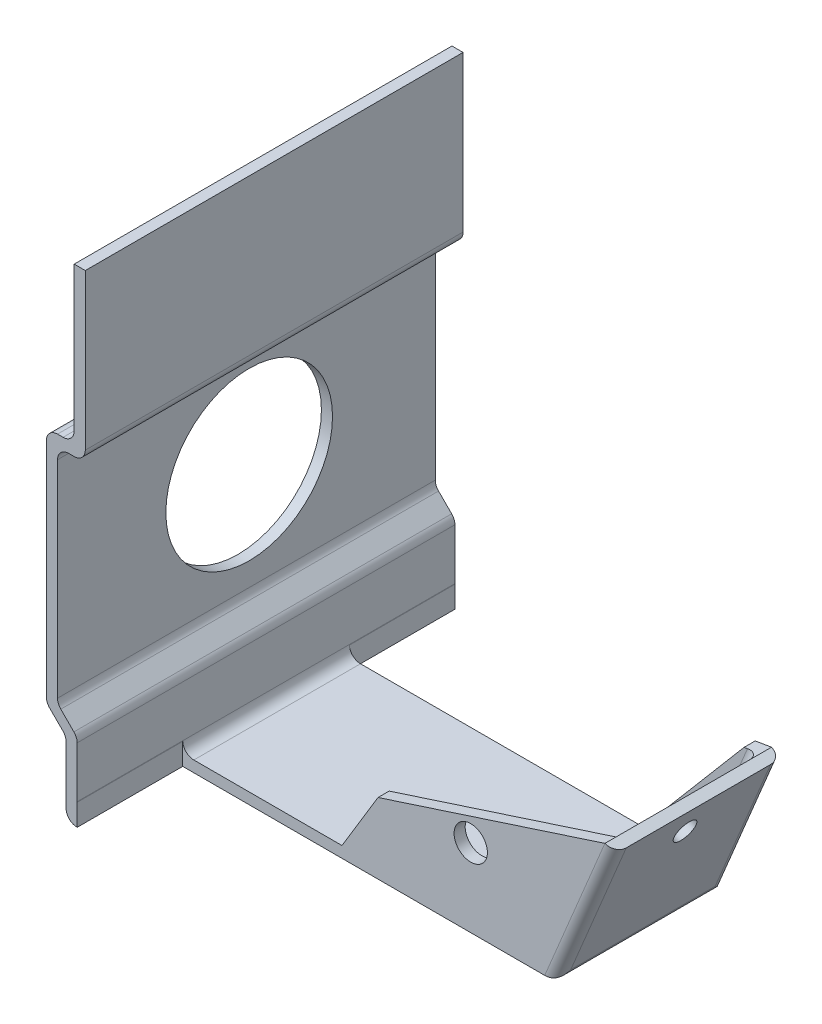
ISO-10303-21;
HEADER;
FILE_DESCRIPTION(('STEP AP214'),'2;1');
FILE_NAME('part.step','',(''),(''),'','','');
FILE_SCHEMA(('AUTOMOTIVE_DESIGN { 1 0 10303 214 1 1 1 1 }'));
ENDSEC;
DATA;
#1=APPLICATION_CONTEXT('core data for automotive mechanical design processes');
#2=APPLICATION_PROTOCOL_DEFINITION('international standard','automotive_design',2000,#1);
#3=PRODUCT_CONTEXT('',#1,'mechanical');
#4=PRODUCT('Part','Part','',(#3));
#5=PRODUCT_RELATED_PRODUCT_CATEGORY('part','',(#4));
#6=PRODUCT_DEFINITION_FORMATION('','',#4);
#7=PRODUCT_DEFINITION_CONTEXT('part definition',#1,'design');
#8=PRODUCT_DEFINITION('design','',#6,#7);
#9=PRODUCT_DEFINITION_SHAPE('','',#8);
#10=(LENGTH_UNIT() NAMED_UNIT(*) SI_UNIT(.MILLI.,.METRE.));
#11=(NAMED_UNIT(*) PLANE_ANGLE_UNIT() SI_UNIT($,.RADIAN.));
#12=(NAMED_UNIT(*) SI_UNIT($,.STERADIAN.) SOLID_ANGLE_UNIT());
#13=UNCERTAINTY_MEASURE_WITH_UNIT(LENGTH_MEASURE(1.E-05),#10,'distance_accuracy_value','');
#14=(GEOMETRIC_REPRESENTATION_CONTEXT(3) GLOBAL_UNCERTAINTY_ASSIGNED_CONTEXT((#13)) GLOBAL_UNIT_ASSIGNED_CONTEXT((#10,
#11,#12)) REPRESENTATION_CONTEXT('',''));
#15=CARTESIAN_POINT('',(0.,0.,0.));
#16=DIRECTION('',(0.,0.,1.));
#17=DIRECTION('',(1.,0.,0.));
#18=AXIS2_PLACEMENT_3D('',#15,#16,#17);
#19=CARTESIAN_POINT('',(10.5759135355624,-30.3072746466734,47.));
#20=DIRECTION('',(-0.923076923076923,0.384615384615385,0.));
#21=DIRECTION('',(-0.384615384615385,-0.923076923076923,0.));
#22=AXIS2_PLACEMENT_3D('',#19,#20,#21);
#23=PLANE('',#22);
#24=CARTESIAN_POINT('',(18.6528366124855,-10.922659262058,24.));
#25=DIRECTION('',(-0.923076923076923,0.384615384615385,0.));
#26=DIRECTION('',(-0.384615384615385,-0.923076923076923,0.));
#27=AXIS2_PLACEMENT_3D('',#24,#25,#26);
#28=CIRCLE('',#27,2.);
#29=CARTESIAN_POINT('',(17.8836058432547,-12.7688131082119,24.));
#30=VERTEX_POINT('',#29);
#31=EDGE_CURVE('E610',#30,#30,#28,.F.);
#32=ORIENTED_EDGE('',*,*,#31,.T.);
#33=EDGE_LOOP('',(#32));
#34=FACE_BOUND('',#33,.T.);
#35=DIRECTION('',(0.,0.,-1.));
#36=VECTOR('',#35,1.);
#37=CARTESIAN_POINT('',(11.0887340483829,-29.0765054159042,47.));
#38=LINE('',#37,#36);
#39=CARTESIAN_POINT('',(11.0887340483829,-29.0765054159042,12.5));
#40=VERTEX_POINT('',#39);
#41=CARTESIAN_POINT('',(11.0887340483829,-29.0765054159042,36.5));
#42=VERTEX_POINT('',#41);
#43=EDGE_CURVE('E311',#40,#42,#38,.F.);
#44=ORIENTED_EDGE('',*,*,#43,.T.);
#45=DIRECTION('',(0.384615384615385,0.923076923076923,0.));
#46=VECTOR('',#45,1.);
#47=CARTESIAN_POINT('',(20.5759135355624,-6.30727464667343,36.5));
#48=LINE('',#47,#46);
#49=CARTESIAN_POINT('',(20.5759135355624,-6.30727464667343,36.5));
#50=VERTEX_POINT('',#49);
#51=EDGE_CURVE('E301',#42,#50,#48,.T.);
#52=ORIENTED_EDGE('',*,*,#51,.T.);
#53=DIRECTION('',(0.,0.,-1.));
#54=VECTOR('',#53,1.);
#55=CARTESIAN_POINT('',(20.5759135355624,-6.30727464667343,47.));
#56=LINE('',#55,#54);
#57=CARTESIAN_POINT('',(20.5759135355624,-6.30727464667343,12.5));
#58=VERTEX_POINT('',#57);
#59=EDGE_CURVE('E295',#50,#58,#56,.T.);
#60=ORIENTED_EDGE('',*,*,#59,.T.);
#61=DIRECTION('',(-0.384615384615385,-0.923076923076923,0.));
#62=VECTOR('',#61,1.);
#63=CARTESIAN_POINT('',(10.5759135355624,-30.3072746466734,12.5));
#64=LINE('',#63,#62);
#65=EDGE_CURVE('E407',#58,#40,#64,.T.);
#66=ORIENTED_EDGE('',*,*,#65,.T.);
#67=EDGE_LOOP('',(#44,#52,#60,#66));
#68=FACE_BOUND('',#67,.T.);
#69=ADVANCED_FACE('F33',(#34,#68),#23,.T.);
#70=CARTESIAN_POINT('',(9.24258020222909,-28.3072746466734,47.));
#71=DIRECTION('',(0.,0.,1.));
#72=DIRECTION('',(1.,0.,0.));
#73=AXIS2_PLACEMENT_3D('',#70,#71,#72);
#74=CYLINDRICAL_SURFACE('',#73,2.);
#75=CARTESIAN_POINT('',(9.24258020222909,-28.3072746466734,36.5));
#76=DIRECTION('',(0.,0.,1.));
#77=DIRECTION('',(1.,0.,0.));
#78=AXIS2_PLACEMENT_3D('',#75,#76,#77);
#79=CIRCLE('',#78,2.);
#80=CARTESIAN_POINT('',(9.24258020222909,-30.3072746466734,36.5));
#81=VERTEX_POINT('',#80);
#82=EDGE_CURVE('E1291',#81,#42,#79,.T.);
#83=ORIENTED_EDGE('',*,*,#82,.T.);
#84=ORIENTED_EDGE('',*,*,#43,.F.);
#85=CARTESIAN_POINT('',(9.24258020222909,-28.3072746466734,12.5));
#86=DIRECTION('',(-0.271964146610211,-0.652713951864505,0.707106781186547));
#87=DIRECTION('',(-0.271964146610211,-0.652713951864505,-0.707106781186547));
#88=AXIS2_PLACEMENT_3D('',#85,#86,#87);
#89=ELLIPSE('',#88,2.82842712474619,2.);
#90=CARTESIAN_POINT('',(9.24258020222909,-30.3072746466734,10.6538461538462));
#91=VERTEX_POINT('',#90);
#92=EDGE_CURVE('E409',#40,#91,#89,.F.);
#93=ORIENTED_EDGE('',*,*,#92,.T.);
#94=DIRECTION('',(0.,0.,-1.));
#95=VECTOR('',#94,1.);
#96=CARTESIAN_POINT('',(9.24258020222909,-30.3072746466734,0.));
#97=LINE('',#96,#95);
#98=EDGE_CURVE('E333',#81,#91,#97,.T.);
#99=ORIENTED_EDGE('',*,*,#98,.F.);
#100=EDGE_LOOP('',(#83,#84,#93,#99));
#101=FACE_BOUND('',#100,.T.);
#102=ADVANCED_FACE('F731',(#101),#74,.F.);
#103=CARTESIAN_POINT('',(12.4220673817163,-31.0765054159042,47.));
#104=DIRECTION('',(-0.923076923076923,0.384615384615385,0.));
#105=DIRECTION('',(-0.384615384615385,-0.923076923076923,0.));
#106=AXIS2_PLACEMENT_3D('',#103,#104,#105);
#107=PLANE('',#106);
#108=CARTESIAN_POINT('',(20.4989904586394,-11.6918900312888,24.));
#109=DIRECTION('',(0.923076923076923,-0.384615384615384,0.));
#110=DIRECTION('',(0.384615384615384,0.923076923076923,0.));
#111=AXIS2_PLACEMENT_3D('',#108,#109,#110);
#112=CIRCLE('',#111,2.);
#113=CARTESIAN_POINT('',(21.2682212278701,-9.84573618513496,24.));
#114=VERTEX_POINT('',#113);
#115=EDGE_CURVE('E613',#114,#114,#112,.T.);
#116=ORIENTED_EDGE('',*,*,#115,.F.);
#117=EDGE_LOOP('',(#116));
#118=FACE_BOUND('',#117,.T.);
#119=DIRECTION('',(0.,0.,-1.));
#120=VECTOR('',#119,1.);
#121=CARTESIAN_POINT('',(22.4220673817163,-7.07650541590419,47.));
#122=LINE('',#121,#120);
#123=CARTESIAN_POINT('',(22.4220673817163,-7.07650541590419,36.5));
#124=VERTEX_POINT('',#123);
#125=CARTESIAN_POINT('',(22.4220673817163,-7.07650541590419,10.5));
#126=VERTEX_POINT('',#125);
#127=EDGE_CURVE('E294',#124,#126,#122,.T.);
#128=ORIENTED_EDGE('',*,*,#127,.F.);
#129=DIRECTION('',(-0.384615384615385,-0.923076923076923,0.));
#130=VECTOR('',#129,1.);
#131=CARTESIAN_POINT('',(12.4220673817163,-31.0765054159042,36.5));
#132=LINE('',#131,#130);
#133=CARTESIAN_POINT('',(12.4220673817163,-31.0765054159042,36.5));
#134=VERTEX_POINT('',#133);
#135=EDGE_CURVE('E418',#124,#134,#132,.T.);
#136=ORIENTED_EDGE('',*,*,#135,.T.);
#137=DIRECTION('',(0.,0.,-1.));
#138=VECTOR('',#137,1.);
#139=CARTESIAN_POINT('',(12.4220673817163,-31.0765054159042,47.));
#140=LINE('',#139,#138);
#141=CARTESIAN_POINT('',(12.4220673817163,-31.0765054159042,10.5));
#142=VERTEX_POINT('',#141);
#143=EDGE_CURVE('E336',#134,#142,#140,.T.);
#144=ORIENTED_EDGE('',*,*,#143,.T.);
#145=DIRECTION('',(0.384615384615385,0.923076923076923,0.));
#146=VECTOR('',#145,1.);
#147=CARTESIAN_POINT('',(12.4220673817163,-31.0765054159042,10.5));
#148=LINE('',#147,#146);
#149=EDGE_CURVE('E395',#142,#126,#148,.T.);
#150=ORIENTED_EDGE('',*,*,#149,.T.);
#151=EDGE_LOOP('',(#128,#136,#144,#150));
#152=FACE_BOUND('',#151,.T.);
#153=ADVANCED_FACE('F432',(#118,#152),#107,.F.);
#154=CARTESIAN_POINT('',(20.5759135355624,-6.30727464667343,47.));
#155=DIRECTION('',(0.384615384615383,0.923076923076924,0.));
#156=DIRECTION('',(-0.923076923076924,0.384615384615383,0.));
#157=AXIS2_PLACEMENT_3D('',#154,#155,#156);
#158=PLANE('',#157);
#159=CARTESIAN_POINT('',(20.5759135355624,-6.30727464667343,38.5));
#160=VERTEX_POINT('',#159);
#161=EDGE_CURVE('E285',#160,#50,#56,.T.);
#162=ORIENTED_EDGE('',*,*,#161,.F.);
#163=CARTESIAN_POINT('',(20.5759135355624,-6.30727464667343,36.5));
#164=DIRECTION('',(0.384615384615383,0.923076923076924,0.));
#165=DIRECTION('',(-0.923076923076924,0.384615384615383,0.));
#166=AXIS2_PLACEMENT_3D('',#163,#164,#165);
#167=CIRCLE('',#166,2.);
#168=EDGE_CURVE('E11',#160,#124,#167,.T.);
#169=ORIENTED_EDGE('',*,*,#168,.T.);
#170=ORIENTED_EDGE('',*,*,#127,.T.);
#171=CARTESIAN_POINT('',(20.5759135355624,-6.30727464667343,10.5));
#172=DIRECTION('',(0.384615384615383,0.923076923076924,0.));
#173=DIRECTION('',(-0.923076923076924,0.384615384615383,0.));
#174=AXIS2_PLACEMENT_3D('',#171,#172,#173);
#175=CIRCLE('',#174,2.);
#176=CARTESIAN_POINT('',(20.5759135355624,-6.30727464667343,8.50000000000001));
#177=VERTEX_POINT('',#176);
#178=EDGE_CURVE('E398',#126,#177,#175,.T.);
#179=ORIENTED_EDGE('',*,*,#178,.T.);
#180=DIRECTION('',(0.,0.,-1.));
#181=VECTOR('',#180,1.);
#182=CARTESIAN_POINT('',(20.5759135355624,-6.30727464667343,10.5));
#183=LINE('',#182,#181);
#184=EDGE_CURVE('E316',#58,#177,#183,.T.);
#185=ORIENTED_EDGE('',*,*,#184,.F.);
#186=ORIENTED_EDGE('',*,*,#59,.F.);
#187=EDGE_LOOP('',(#162,#169,#170,#179,#185,#186));
#188=FACE_BOUND('',#187,.T.);
#189=ADVANCED_FACE('F314',(#188),#158,.T.);
#190=CARTESIAN_POINT('',(-55.4240864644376,-30.3072746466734,47.));
#191=DIRECTION('',(0.,1.,0.));
#192=DIRECTION('',(0.,0.,1.));
#193=AXIS2_PLACEMENT_3D('',#190,#191,#192);
#194=PLANE('',#193);
#195=DIRECTION('',(0.,0.,1.));
#196=VECTOR('',#195,1.);
#197=CARTESIAN_POINT('',(-26.7574197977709,-30.3072746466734,36.5));
#198=LINE('',#197,#196);
#199=CARTESIAN_POINT('',(-26.7574197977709,-30.3072746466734,36.5));
#200=VERTEX_POINT('',#199);
#201=CARTESIAN_POINT('',(-26.7574197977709,-30.3072746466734,38.5));
#202=VERTEX_POINT('',#201);
#203=EDGE_CURVE('E462',#200,#202,#198,.T.);
#204=ORIENTED_EDGE('',*,*,#203,.F.);
#205=DIRECTION('',(1.,0.,0.));
#206=VECTOR('',#205,1.);
#207=CARTESIAN_POINT('',(9.24258020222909,-30.3072746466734,36.5));
#208=LINE('',#207,#206);
#209=EDGE_CURVE('E1288',#200,#81,#208,.T.);
#210=ORIENTED_EDGE('',*,*,#209,.T.);
#211=ORIENTED_EDGE('',*,*,#98,.T.);
#212=CARTESIAN_POINT('',(8.40924686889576,-30.3072746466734,12.5));
#213=DIRECTION('',(0.,1.,0.));
#214=DIRECTION('',(-1.,0.,0.));
#215=AXIS2_PLACEMENT_3D('',#212,#213,#214);
#216=ELLIPSE('',#215,2.16666666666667,2.);
#217=CARTESIAN_POINT('',(8.40924686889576,-30.3072746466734,10.5));
#218=VERTEX_POINT('',#217);
#219=EDGE_CURVE('E412',#91,#218,#216,.T.);
#220=ORIENTED_EDGE('',*,*,#219,.T.);
#221=DIRECTION('',(-1.,0.,0.));
#222=VECTOR('',#221,1.);
#223=CARTESIAN_POINT('',(-2.31468607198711,-30.3072746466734,10.5));
#224=LINE('',#223,#222);
#225=CARTESIAN_POINT('',(-2.31468607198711,-30.3072746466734,10.5));
#226=VERTEX_POINT('',#225);
#227=EDGE_CURVE('E458',#218,#226,#224,.T.);
#228=ORIENTED_EDGE('',*,*,#227,.T.);
#229=DIRECTION('',(0.,0.,-1.));
#230=VECTOR('',#229,1.);
#231=CARTESIAN_POINT('',(-2.31468607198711,-30.3072746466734,10.5));
#232=LINE('',#231,#230);
#233=CARTESIAN_POINT('',(-2.31468607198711,-30.3072746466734,8.50000000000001));
#234=VERTEX_POINT('',#233);
#235=EDGE_CURVE('E467',#226,#234,#232,.T.);
#236=ORIENTED_EDGE('',*,*,#235,.T.);
#237=DIRECTION('',(1.,0.,0.));
#238=VECTOR('',#237,1.);
#239=CARTESIAN_POINT('',(-55.4240864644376,-30.3072746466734,8.50000000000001));
#240=LINE('',#239,#238);
#241=CARTESIAN_POINT('',(-53.4240864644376,-30.3072746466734,8.50000000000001));
#242=VERTEX_POINT('',#241);
#243=EDGE_CURVE('E476',#242,#234,#240,.T.);
#244=ORIENTED_EDGE('',*,*,#243,.F.);
#245=DIRECTION('',(0.,0.,-1.));
#246=VECTOR('',#245,1.);
#247=CARTESIAN_POINT('',(-53.4240864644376,-30.3072746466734,57.5));
#248=LINE('',#247,#246);
#249=CARTESIAN_POINT('',(-53.4240864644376,-30.3072746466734,38.5));
#250=VERTEX_POINT('',#249);
#251=EDGE_CURVE('E376',#242,#250,#248,.F.);
#252=ORIENTED_EDGE('',*,*,#251,.T.);
#253=DIRECTION('',(-1.,0.,0.));
#254=VECTOR('',#253,1.);
#255=CARTESIAN_POINT('',(-55.4240864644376,-30.3072746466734,38.5));
#256=LINE('',#255,#254);
#257=EDGE_CURVE('E484',#202,#250,#256,.T.);
#258=ORIENTED_EDGE('',*,*,#257,.F.);
#259=EDGE_LOOP('',(#204,#210,#211,#220,#228,#236,#244,#252,#258));
#260=FACE_BOUND('',#259,.T.);
#261=ADVANCED_FACE('F741',(#260),#194,.T.);
#262=CARTESIAN_POINT('',(-55.4240864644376,-18.3072746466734,47.));
#263=DIRECTION('',(1.,0.,0.));
#264=DIRECTION('',(0.,0.,-1.));
#265=AXIS2_PLACEMENT_3D('',#262,#263,#264);
#266=PLANE('',#265);
#267=DIRECTION('',(0.,1.,0.));
#268=VECTOR('',#267,1.);
#269=CARTESIAN_POINT('',(-55.4240864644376,-30.3072746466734,57.5));
#270=LINE('',#269,#268);
#271=CARTESIAN_POINT('',(-55.4240864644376,-28.3072746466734,57.5));
#272=VERTEX_POINT('',#271);
#273=CARTESIAN_POINT('',(-55.4240864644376,-19.1357017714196,57.5));
#274=VERTEX_POINT('',#273);
#275=EDGE_CURVE('E554',#272,#274,#270,.T.);
#276=ORIENTED_EDGE('',*,*,#275,.F.);
#277=DIRECTION('',(0.,0.,-1.));
#278=VECTOR('',#277,1.);
#279=CARTESIAN_POINT('',(-55.4240864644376,-28.3072746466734,-10.5));
#280=LINE('',#279,#278);
#281=CARTESIAN_POINT('',(-55.4240864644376,-28.3072746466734,-10.5));
#282=VERTEX_POINT('',#281);
#283=EDGE_CURVE('E373',#272,#282,#280,.T.);
#284=ORIENTED_EDGE('',*,*,#283,.T.);
#285=DIRECTION('',(0.,-1.,0.));
#286=VECTOR('',#285,1.);
#287=CARTESIAN_POINT('',(-55.4240864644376,-19.1357017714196,-10.5));
#288=LINE('',#287,#286);
#289=CARTESIAN_POINT('',(-55.4240864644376,-19.1357017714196,-10.5));
#290=VERTEX_POINT('',#289);
#291=EDGE_CURVE('E545',#290,#282,#288,.T.);
#292=ORIENTED_EDGE('',*,*,#291,.F.);
#293=DIRECTION('',(0.,0.,-1.));
#294=VECTOR('',#293,1.);
#295=CARTESIAN_POINT('',(-55.4240864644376,-19.1357017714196,47.));
#296=LINE('',#295,#294);
#297=EDGE_CURVE('E346',#290,#274,#296,.F.);
#298=ORIENTED_EDGE('',*,*,#297,.T.);
#299=EDGE_LOOP('',(#276,#284,#292,#298));
#300=FACE_BOUND('',#299,.T.);
#301=ADVANCED_FACE('F670',(#300),#266,.T.);
#302=CARTESIAN_POINT('',(-58.9596203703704,-14.7717407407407,47.));
#303=DIRECTION('',(0.707106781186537,0.707106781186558,0.));
#304=DIRECTION('',(-0.707106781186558,0.707106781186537,0.));
#305=AXIS2_PLACEMENT_3D('',#302,#303,#304);
#306=PLANE('',#305);
#307=DIRECTION('',(0.,0.,-1.));
#308=VECTOR('',#307,1.);
#309=CARTESIAN_POINT('',(-58.3738339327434,-15.3575271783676,47.));
#310=LINE('',#309,#308);
#311=CARTESIAN_POINT('',(-58.3738339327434,-15.3575271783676,-10.5));
#312=VERTEX_POINT('',#311);
#313=CARTESIAN_POINT('',(-58.3738339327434,-15.3575271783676,57.5));
#314=VERTEX_POINT('',#313);
#315=EDGE_CURVE('E342',#312,#314,#310,.F.);
#316=ORIENTED_EDGE('',*,*,#315,.T.);
#317=DIRECTION('',(-0.707106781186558,0.707106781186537,0.));
#318=VECTOR('',#317,1.);
#319=CARTESIAN_POINT('',(-56.0098729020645,-17.7214882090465,57.5));
#320=LINE('',#319,#318);
#321=CARTESIAN_POINT('',(-56.0098729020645,-17.7214882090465,57.5));
#322=VERTEX_POINT('',#321);
#323=EDGE_CURVE('E559',#322,#314,#320,.T.);
#324=ORIENTED_EDGE('',*,*,#323,.F.);
#325=DIRECTION('',(0.,0.,-1.));
#326=VECTOR('',#325,1.);
#327=CARTESIAN_POINT('',(-56.0098729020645,-17.7214882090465,47.));
#328=LINE('',#327,#326);
#329=CARTESIAN_POINT('',(-56.0098729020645,-17.7214882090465,-10.5));
#330=VERTEX_POINT('',#329);
#331=EDGE_CURVE('E344',#322,#330,#328,.T.);
#332=ORIENTED_EDGE('',*,*,#331,.T.);
#333=DIRECTION('',(0.707106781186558,-0.707106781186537,0.));
#334=VECTOR('',#333,1.);
#335=CARTESIAN_POINT('',(-58.3738339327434,-15.3575271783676,-10.5));
#336=LINE('',#335,#334);
#337=EDGE_CURVE('E539',#312,#330,#336,.T.);
#338=ORIENTED_EDGE('',*,*,#337,.F.);
#339=EDGE_LOOP('',(#316,#324,#332,#338));
#340=FACE_BOUND('',#339,.T.);
#341=ADVANCED_FACE('F662',(#340),#306,.T.);
#342=CARTESIAN_POINT('',(-58.9596203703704,25.2282592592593,47.));
#343=DIRECTION('',(1.,0.,0.));
#344=DIRECTION('',(0.,1.,0.));
#345=AXIS2_PLACEMENT_3D('',#342,#343,#344);
#346=PLANE('',#345);
#347=CARTESIAN_POINT('',(-58.9596203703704,5.22825925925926,23.));
#348=DIRECTION('',(1.,0.,0.));
#349=DIRECTION('',(0.,1.,0.));
#350=AXIS2_PLACEMENT_3D('',#347,#348,#349);
#351=CIRCLE('',#350,15.);
#352=CARTESIAN_POINT('',(-58.9596203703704,20.2282592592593,23.));
#353=VERTEX_POINT('',#352);
#354=EDGE_CURVE('E616',#353,#353,#351,.F.);
#355=ORIENTED_EDGE('',*,*,#354,.T.);
#356=EDGE_LOOP('',(#355));
#357=FACE_BOUND('',#356,.T.);
#358=DIRECTION('',(0.,0.,-1.));
#359=VECTOR('',#358,1.);
#360=CARTESIAN_POINT('',(-58.9596203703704,23.2282592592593,47.));
#361=LINE('',#360,#359);
#362=CARTESIAN_POINT('',(-58.9596203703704,23.2282592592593,-10.5));
#363=VERTEX_POINT('',#362);
#364=CARTESIAN_POINT('',(-58.9596203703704,23.2282592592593,57.5));
#365=VERTEX_POINT('',#364);
#366=EDGE_CURVE('E349',#363,#365,#361,.F.);
#367=ORIENTED_EDGE('',*,*,#366,.T.);
#368=DIRECTION('',(0.,1.,0.));
#369=VECTOR('',#368,1.);
#370=CARTESIAN_POINT('',(-58.9596203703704,-13.9433136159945,57.5));
#371=LINE('',#370,#369);
#372=CARTESIAN_POINT('',(-58.9596203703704,-13.9433136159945,57.5));
#373=VERTEX_POINT('',#372);
#374=EDGE_CURVE('E565',#373,#365,#371,.T.);
#375=ORIENTED_EDGE('',*,*,#374,.F.);
#376=DIRECTION('',(0.,0.,-1.));
#377=VECTOR('',#376,1.);
#378=CARTESIAN_POINT('',(-58.9596203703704,-13.9433136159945,0.));
#379=LINE('',#378,#377);
#380=CARTESIAN_POINT('',(-58.9596203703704,-13.9433136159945,-10.5));
#381=VERTEX_POINT('',#380);
#382=EDGE_CURVE('E351',#373,#381,#379,.T.);
#383=ORIENTED_EDGE('',*,*,#382,.T.);
#384=DIRECTION('',(0.,-1.,0.));
#385=VECTOR('',#384,1.);
#386=CARTESIAN_POINT('',(-58.9596203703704,23.2282592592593,-10.5));
#387=LINE('',#386,#385);
#388=EDGE_CURVE('E533',#363,#381,#387,.T.);
#389=ORIENTED_EDGE('',*,*,#388,.F.);
#390=EDGE_LOOP('',(#367,#375,#383,#389));
#391=FACE_BOUND('',#390,.T.);
#392=ADVANCED_FACE('F654',(#357,#391),#346,.T.);
#393=CARTESIAN_POINT('',(-53.9596203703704,25.2282592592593,47.));
#394=DIRECTION('',(0.,-1.,0.));
#395=DIRECTION('',(0.,0.,-1.));
#396=AXIS2_PLACEMENT_3D('',#393,#394,#395);
#397=PLANE('',#396);
#398=DIRECTION('',(0.,0.,-1.));
#399=VECTOR('',#398,1.);
#400=CARTESIAN_POINT('',(-55.9596203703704,25.2282592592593,47.));
#401=LINE('',#400,#399);
#402=CARTESIAN_POINT('',(-55.9596203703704,25.2282592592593,-10.5));
#403=VERTEX_POINT('',#402);
#404=CARTESIAN_POINT('',(-55.9596203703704,25.2282592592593,57.5));
#405=VERTEX_POINT('',#404);
#406=EDGE_CURVE('E353',#403,#405,#401,.F.);
#407=ORIENTED_EDGE('',*,*,#406,.T.);
#408=DIRECTION('',(1.,0.,0.));
#409=VECTOR('',#408,1.);
#410=CARTESIAN_POINT('',(-56.9596203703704,25.2282592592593,57.5));
#411=LINE('',#410,#409);
#412=CARTESIAN_POINT('',(-56.9596203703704,25.2282592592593,57.5));
#413=VERTEX_POINT('',#412);
#414=EDGE_CURVE('E571',#413,#405,#411,.T.);
#415=ORIENTED_EDGE('',*,*,#414,.F.);
#416=DIRECTION('',(0.,0.,-1.));
#417=VECTOR('',#416,1.);
#418=CARTESIAN_POINT('',(-56.9596203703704,25.2282592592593,0.));
#419=LINE('',#418,#417);
#420=CARTESIAN_POINT('',(-56.9596203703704,25.2282592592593,-10.5));
#421=VERTEX_POINT('',#420);
#422=EDGE_CURVE('E355',#413,#421,#419,.T.);
#423=ORIENTED_EDGE('',*,*,#422,.T.);
#424=DIRECTION('',(-1.,0.,0.));
#425=VECTOR('',#424,1.);
#426=CARTESIAN_POINT('',(-55.9596203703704,25.2282592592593,-10.5));
#427=LINE('',#426,#425);
#428=EDGE_CURVE('E527',#403,#421,#427,.T.);
#429=ORIENTED_EDGE('',*,*,#428,.F.);
#430=EDGE_LOOP('',(#407,#415,#423,#429));
#431=FACE_BOUND('',#430,.T.);
#432=ADVANCED_FACE('F647',(#431),#397,.T.);
#433=CARTESIAN_POINT('',(-53.9596203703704,55.2282592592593,47.));
#434=DIRECTION('',(1.,0.,0.));
#435=DIRECTION('',(0.,1.,0.));
#436=AXIS2_PLACEMENT_3D('',#433,#434,#435);
#437=PLANE('',#436);
#438=DIRECTION('',(0.,0.,-1.));
#439=VECTOR('',#438,1.);
#440=CARTESIAN_POINT('',(-53.9596203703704,55.2282592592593,47.));
#441=LINE('',#440,#439);
#442=CARTESIAN_POINT('',(-53.9596203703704,55.2282592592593,57.5));
#443=VERTEX_POINT('',#442);
#444=CARTESIAN_POINT('',(-53.9596203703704,55.2282592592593,-10.5));
#445=VERTEX_POINT('',#444);
#446=EDGE_CURVE('E318',#443,#445,#441,.T.);
#447=ORIENTED_EDGE('',*,*,#446,.F.);
#448=DIRECTION('',(0.,1.,0.));
#449=VECTOR('',#448,1.);
#450=CARTESIAN_POINT('',(-53.9596203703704,27.2282592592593,57.5));
#451=LINE('',#450,#449);
#452=CARTESIAN_POINT('',(-53.9596203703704,27.2282592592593,57.5));
#453=VERTEX_POINT('',#452);
#454=EDGE_CURVE('E577',#453,#443,#451,.T.);
#455=ORIENTED_EDGE('',*,*,#454,.F.);
#456=DIRECTION('',(0.,0.,-1.));
#457=VECTOR('',#456,1.);
#458=CARTESIAN_POINT('',(-53.9596203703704,27.2282592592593,47.));
#459=LINE('',#458,#457);
#460=CARTESIAN_POINT('',(-53.9596203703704,27.2282592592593,-10.5));
#461=VERTEX_POINT('',#460);
#462=EDGE_CURVE('E357',#453,#461,#459,.T.);
#463=ORIENTED_EDGE('',*,*,#462,.T.);
#464=DIRECTION('',(0.,-1.,0.));
#465=VECTOR('',#464,1.);
#466=CARTESIAN_POINT('',(-53.9596203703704,55.2282592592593,-10.5));
#467=LINE('',#466,#465);
#468=EDGE_CURVE('E521',#445,#461,#467,.T.);
#469=ORIENTED_EDGE('',*,*,#468,.F.);
#470=EDGE_LOOP('',(#447,#455,#463,#469));
#471=FACE_BOUND('',#470,.T.);
#472=ADVANCED_FACE('F636',(#471),#437,.T.);
#473=CARTESIAN_POINT('',(-55.9596203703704,55.2282592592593,47.));
#474=DIRECTION('',(0.,1.,0.));
#475=DIRECTION('',(0.,0.,1.));
#476=AXIS2_PLACEMENT_3D('',#473,#474,#475);
#477=PLANE('',#476);
#478=ORIENTED_EDGE('',*,*,#446,.T.);
#479=DIRECTION('',(1.,0.,0.));
#480=VECTOR('',#479,1.);
#481=CARTESIAN_POINT('',(-55.9596203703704,55.2282592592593,-10.5));
#482=LINE('',#481,#480);
#483=CARTESIAN_POINT('',(-55.9596203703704,55.2282592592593,-10.5));
#484=VERTEX_POINT('',#483);
#485=EDGE_CURVE('E518',#484,#445,#482,.T.);
#486=ORIENTED_EDGE('',*,*,#485,.F.);
#487=DIRECTION('',(0.,0.,-1.));
#488=VECTOR('',#487,1.);
#489=CARTESIAN_POINT('',(-55.9596203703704,55.2282592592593,47.));
#490=LINE('',#489,#488);
#491=CARTESIAN_POINT('',(-55.9596203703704,55.2282592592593,57.5));
#492=VERTEX_POINT('',#491);
#493=EDGE_CURVE('E319',#492,#484,#490,.T.);
#494=ORIENTED_EDGE('',*,*,#493,.F.);
#495=DIRECTION('',(-1.,0.,0.));
#496=VECTOR('',#495,1.);
#497=CARTESIAN_POINT('',(-53.9596203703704,55.2282592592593,57.5));
#498=LINE('',#497,#496);
#499=EDGE_CURVE('E580',#443,#492,#498,.T.);
#500=ORIENTED_EDGE('',*,*,#499,.F.);
#501=EDGE_LOOP('',(#478,#486,#494,#500));
#502=FACE_BOUND('',#501,.T.);
#503=ADVANCED_FACE('F633',(#502),#477,.T.);
#504=CARTESIAN_POINT('',(-55.9596203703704,55.2282592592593,47.));
#505=DIRECTION('',(1.,0.,0.));
#506=DIRECTION('',(0.,1.,0.));
#507=AXIS2_PLACEMENT_3D('',#504,#505,#506);
#508=PLANE('',#507);
#509=ORIENTED_EDGE('',*,*,#493,.T.);
#510=DIRECTION('',(0.,1.,0.));
#511=VECTOR('',#510,1.);
#512=CARTESIAN_POINT('',(-55.9596203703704,29.2282592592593,-10.5));
#513=LINE('',#512,#511);
#514=CARTESIAN_POINT('',(-55.9596203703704,29.2282592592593,-10.5));
#515=VERTEX_POINT('',#514);
#516=EDGE_CURVE('E515',#515,#484,#513,.T.);
#517=ORIENTED_EDGE('',*,*,#516,.F.);
#518=DIRECTION('',(0.,0.,-1.));
#519=VECTOR('',#518,1.);
#520=CARTESIAN_POINT('',(-55.9596203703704,29.2282592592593,47.));
#521=LINE('',#520,#519);
#522=CARTESIAN_POINT('',(-55.9596203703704,29.2282592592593,57.5));
#523=VERTEX_POINT('',#522);
#524=EDGE_CURVE('E367',#515,#523,#521,.F.);
#525=ORIENTED_EDGE('',*,*,#524,.T.);
#526=DIRECTION('',(0.,-1.,0.));
#527=VECTOR('',#526,1.);
#528=CARTESIAN_POINT('',(-55.9596203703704,55.2282592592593,57.5));
#529=LINE('',#528,#527);
#530=EDGE_CURVE('E583',#492,#523,#529,.T.);
#531=ORIENTED_EDGE('',*,*,#530,.F.);
#532=EDGE_LOOP('',(#509,#517,#525,#531));
#533=FACE_BOUND('',#532,.T.);
#534=ADVANCED_FACE('F624',(#533),#508,.F.);
#535=CARTESIAN_POINT('',(-53.9596203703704,27.2282592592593,47.));
#536=DIRECTION('',(0.,-1.,0.));
#537=DIRECTION('',(0.,0.,-1.));
#538=AXIS2_PLACEMENT_3D('',#535,#536,#537);
#539=PLANE('',#538);
#540=DIRECTION('',(0.,0.,-1.));
#541=VECTOR('',#540,1.);
#542=CARTESIAN_POINT('',(-57.9596203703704,27.2282592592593,0.));
#543=LINE('',#542,#541);
#544=CARTESIAN_POINT('',(-57.9596203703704,27.2282592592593,57.5));
#545=VERTEX_POINT('',#544);
#546=CARTESIAN_POINT('',(-57.9596203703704,27.2282592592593,-10.5));
#547=VERTEX_POINT('',#546);
#548=EDGE_CURVE('E363',#545,#547,#543,.T.);
#549=ORIENTED_EDGE('',*,*,#548,.T.);
#550=DIRECTION('',(1.,0.,0.));
#551=VECTOR('',#550,1.);
#552=CARTESIAN_POINT('',(-58.9596203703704,27.2282592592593,-10.5));
#553=LINE('',#552,#551);
#554=CARTESIAN_POINT('',(-58.9596203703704,27.2282592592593,-10.5));
#555=VERTEX_POINT('',#554);
#556=EDGE_CURVE('E509',#555,#547,#553,.T.);
#557=ORIENTED_EDGE('',*,*,#556,.F.);
#558=DIRECTION('',(0.,0.,-1.));
#559=VECTOR('',#558,1.);
#560=CARTESIAN_POINT('',(-58.9596203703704,27.2282592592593,47.));
#561=LINE('',#560,#559);
#562=CARTESIAN_POINT('',(-58.9596203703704,27.2282592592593,57.5));
#563=VERTEX_POINT('',#562);
#564=EDGE_CURVE('E365',#555,#563,#561,.F.);
#565=ORIENTED_EDGE('',*,*,#564,.T.);
#566=DIRECTION('',(-1.,0.,0.));
#567=VECTOR('',#566,1.);
#568=CARTESIAN_POINT('',(-57.9596203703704,27.2282592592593,57.5));
#569=LINE('',#568,#567);
#570=EDGE_CURVE('E589',#545,#563,#569,.T.);
#571=ORIENTED_EDGE('',*,*,#570,.F.);
#572=EDGE_LOOP('',(#549,#557,#565,#571));
#573=FACE_BOUND('',#572,.T.);
#574=ADVANCED_FACE('F714',(#573),#539,.F.);
#575=CARTESIAN_POINT('',(-60.9596203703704,25.2282592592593,47.));
#576=DIRECTION('',(1.,0.,0.));
#577=DIRECTION('',(0.,1.,0.));
#578=AXIS2_PLACEMENT_3D('',#575,#576,#577);
#579=PLANE('',#578);
#580=CARTESIAN_POINT('',(-60.9596203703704,5.22825925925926,23.));
#581=DIRECTION('',(-1.,0.,0.));
#582=DIRECTION('',(0.,0.,1.));
#583=AXIS2_PLACEMENT_3D('',#580,#581,#582);
#584=CIRCLE('',#583,15.);
#585=CARTESIAN_POINT('',(-60.9596203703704,5.22825925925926,38.));
#586=VERTEX_POINT('',#585);
#587=EDGE_CURVE('E617',#586,#586,#584,.T.);
#588=ORIENTED_EDGE('',*,*,#587,.F.);
#589=EDGE_LOOP('',(#588));
#590=FACE_BOUND('',#589,.T.);
#591=DIRECTION('',(0.,0.,-1.));
#592=VECTOR('',#591,1.);
#593=CARTESIAN_POINT('',(-60.9596203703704,25.2282592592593,47.));
#594=LINE('',#593,#592);
#595=CARTESIAN_POINT('',(-60.9596203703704,25.2282592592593,57.5));
#596=VERTEX_POINT('',#595);
#597=CARTESIAN_POINT('',(-60.9596203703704,25.2282592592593,-10.5));
#598=VERTEX_POINT('',#597);
#599=EDGE_CURVE('E359',#596,#598,#594,.T.);
#600=ORIENTED_EDGE('',*,*,#599,.T.);
#601=DIRECTION('',(0.,1.,0.));
#602=VECTOR('',#601,1.);
#603=CARTESIAN_POINT('',(-60.9596203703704,-14.7717407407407,-10.5));
#604=LINE('',#603,#602);
#605=CARTESIAN_POINT('',(-60.9596203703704,-14.7717407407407,-10.5));
#606=VERTEX_POINT('',#605);
#607=EDGE_CURVE('E503',#606,#598,#604,.T.);
#608=ORIENTED_EDGE('',*,*,#607,.F.);
#609=DIRECTION('',(0.,0.,-1.));
#610=VECTOR('',#609,1.);
#611=CARTESIAN_POINT('',(-60.9596203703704,-14.7717407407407,47.));
#612=LINE('',#611,#610);
#613=CARTESIAN_POINT('',(-60.9596203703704,-14.7717407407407,57.5));
#614=VERTEX_POINT('',#613);
#615=EDGE_CURVE('E361',#606,#614,#612,.F.);
#616=ORIENTED_EDGE('',*,*,#615,.T.);
#617=DIRECTION('',(0.,-1.,0.));
#618=VECTOR('',#617,1.);
#619=CARTESIAN_POINT('',(-60.9596203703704,25.2282592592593,57.5));
#620=LINE('',#619,#618);
#621=EDGE_CURVE('E595',#596,#614,#620,.T.);
#622=ORIENTED_EDGE('',*,*,#621,.F.);
#623=EDGE_LOOP('',(#600,#608,#616,#622));
#624=FACE_BOUND('',#623,.T.);
#625=ADVANCED_FACE('F706',(#590,#624),#579,.F.);
#626=CARTESIAN_POINT('',(-60.3738339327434,-16.1859543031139,47.));
#627=DIRECTION('',(0.707106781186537,0.707106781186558,0.));
#628=DIRECTION('',(-0.707106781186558,0.707106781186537,0.));
#629=AXIS2_PLACEMENT_3D('',#626,#627,#628);
#630=PLANE('',#629);
#631=DIRECTION('',(0.,0.,-1.));
#632=VECTOR('',#631,1.);
#633=CARTESIAN_POINT('',(-60.3738339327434,-16.1859543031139,47.));
#634=LINE('',#633,#632);
#635=CARTESIAN_POINT('',(-60.3738339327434,-16.1859543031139,57.5));
#636=VERTEX_POINT('',#635);
#637=CARTESIAN_POINT('',(-60.3738339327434,-16.1859543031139,-10.5));
#638=VERTEX_POINT('',#637);
#639=EDGE_CURVE('E338',#636,#638,#634,.T.);
#640=ORIENTED_EDGE('',*,*,#639,.T.);
#641=DIRECTION('',(-0.707106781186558,0.707106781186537,0.));
#642=VECTOR('',#641,1.);
#643=CARTESIAN_POINT('',(-58.0098729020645,-18.5499153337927,-10.5));
#644=LINE('',#643,#642);
#645=CARTESIAN_POINT('',(-58.0098729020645,-18.5499153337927,-10.5));
#646=VERTEX_POINT('',#645);
#647=EDGE_CURVE('E497',#646,#638,#644,.T.);
#648=ORIENTED_EDGE('',*,*,#647,.F.);
#649=DIRECTION('',(0.,0.,-1.));
#650=VECTOR('',#649,1.);
#651=CARTESIAN_POINT('',(-58.0098729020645,-18.5499153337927,47.));
#652=LINE('',#651,#650);
#653=CARTESIAN_POINT('',(-58.0098729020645,-18.5499153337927,57.5));
#654=VERTEX_POINT('',#653);
#655=EDGE_CURVE('E340',#646,#654,#652,.F.);
#656=ORIENTED_EDGE('',*,*,#655,.T.);
#657=DIRECTION('',(0.707106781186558,-0.707106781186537,0.));
#658=VECTOR('',#657,1.);
#659=CARTESIAN_POINT('',(-60.3738339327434,-16.1859543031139,57.5));
#660=LINE('',#659,#658);
#661=EDGE_CURVE('E601',#636,#654,#660,.T.);
#662=ORIENTED_EDGE('',*,*,#661,.F.);
#663=EDGE_LOOP('',(#640,#648,#656,#662));
#664=FACE_BOUND('',#663,.T.);
#665=ADVANCED_FACE('F698',(#664),#630,.F.);
#666=CARTESIAN_POINT('',(-57.4240864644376,-18.3072746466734,47.));
#667=DIRECTION('',(1.,0.,0.));
#668=DIRECTION('',(0.,0.,-1.));
#669=AXIS2_PLACEMENT_3D('',#666,#667,#668);
#670=PLANE('',#669);
#671=DIRECTION('',(0.,0.,-1.));
#672=VECTOR('',#671,1.);
#673=CARTESIAN_POINT('',(-57.4240864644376,-19.9641288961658,0.));
#674=LINE('',#673,#672);
#675=CARTESIAN_POINT('',(-57.4240864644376,-19.9641288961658,57.5));
#676=VERTEX_POINT('',#675);
#677=CARTESIAN_POINT('',(-57.4240864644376,-19.9641288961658,-10.5));
#678=VERTEX_POINT('',#677);
#679=EDGE_CURVE('E329',#676,#678,#674,.T.);
#680=ORIENTED_EDGE('',*,*,#679,.T.);
#681=DIRECTION('',(0.,1.,0.));
#682=VECTOR('',#681,1.);
#683=CARTESIAN_POINT('',(-57.4240864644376,-30.3072746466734,-10.5));
#684=LINE('',#683,#682);
#685=CARTESIAN_POINT('',(-57.4240864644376,-30.3072746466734,-10.5));
#686=VERTEX_POINT('',#685);
#687=EDGE_CURVE('E491',#686,#678,#684,.T.);
#688=ORIENTED_EDGE('',*,*,#687,.F.);
#689=DIRECTION('',(0.,0.,-1.));
#690=VECTOR('',#689,1.);
#691=CARTESIAN_POINT('',(-57.4240864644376,-30.3072746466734,47.));
#692=LINE('',#691,#690);
#693=CARTESIAN_POINT('',(-57.4240864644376,-30.3072746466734,57.5));
#694=VERTEX_POINT('',#693);
#695=EDGE_CURVE('E331',#686,#694,#692,.F.);
#696=ORIENTED_EDGE('',*,*,#695,.T.);
#697=DIRECTION('',(0.,-1.,0.));
#698=VECTOR('',#697,1.);
#699=CARTESIAN_POINT('',(-57.4240864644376,-19.9641288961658,57.5));
#700=LINE('',#699,#698);
#701=EDGE_CURVE('E607',#676,#694,#700,.T.);
#702=ORIENTED_EDGE('',*,*,#701,.F.);
#703=EDGE_LOOP('',(#680,#688,#696,#702));
#704=FACE_BOUND('',#703,.T.);
#705=ADVANCED_FACE('F690',(#704),#670,.F.);
#706=CARTESIAN_POINT('',(-55.4240864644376,-32.3072746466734,47.));
#707=DIRECTION('',(0.,1.,0.));
#708=DIRECTION('',(0.,0.,1.));
#709=AXIS2_PLACEMENT_3D('',#706,#707,#708);
#710=PLANE('',#709);
#711=DIRECTION('',(0.,0.,-1.));
#712=VECTOR('',#711,1.);
#713=CARTESIAN_POINT('',(10.5759135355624,-32.3072746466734,47.));
#714=LINE('',#713,#712);
#715=CARTESIAN_POINT('',(10.5759135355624,-32.3072746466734,8.65384615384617));
#716=VERTEX_POINT('',#715);
#717=CARTESIAN_POINT('',(10.5759135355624,-32.3072746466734,38.3461538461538));
#718=VERTEX_POINT('',#717);
#719=EDGE_CURVE('E324',#716,#718,#714,.F.);
#720=ORIENTED_EDGE('',*,*,#719,.T.);
#721=CARTESIAN_POINT('',(9.74258020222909,-32.3072746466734,36.5));
#722=DIRECTION('',(0.,1.,0.));
#723=DIRECTION('',(-1.,0.,0.));
#724=AXIS2_PLACEMENT_3D('',#721,#722,#723);
#725=ELLIPSE('',#724,2.16666666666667,2.);
#726=CARTESIAN_POINT('',(9.74258020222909,-32.3072746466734,38.5));
#727=VERTEX_POINT('',#726);
#728=EDGE_CURVE('E48',#718,#727,#725,.F.);
#729=ORIENTED_EDGE('',*,*,#728,.T.);
#730=DIRECTION('',(-1.,0.,0.));
#731=VECTOR('',#730,1.);
#732=CARTESIAN_POINT('',(26.2184399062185,-32.3072746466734,38.5));
#733=LINE('',#732,#731);
#734=CARTESIAN_POINT('',(-55.4215600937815,-32.3072746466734,38.5));
#735=VERTEX_POINT('',#734);
#736=EDGE_CURVE('E426',#727,#735,#733,.T.);
#737=ORIENTED_EDGE('',*,*,#736,.T.);
#738=DIRECTION('',(0.,0.,1.));
#739=VECTOR('',#738,1.);
#740=CARTESIAN_POINT('',(-55.4215600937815,-32.3072746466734,66.716573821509));
#741=LINE('',#740,#739);
#742=CARTESIAN_POINT('',(-55.4215600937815,-32.3072746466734,57.5));
#743=VERTEX_POINT('',#742);
#744=EDGE_CURVE('E479',#735,#743,#741,.T.);
#745=ORIENTED_EDGE('',*,*,#744,.T.);
#746=DIRECTION('',(1.,0.,0.));
#747=VECTOR('',#746,1.);
#748=CARTESIAN_POINT('',(-55.4240864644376,-32.3072746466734,57.5));
#749=LINE('',#748,#747);
#750=CARTESIAN_POINT('',(-55.4240864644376,-32.3072746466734,57.5));
#751=VERTEX_POINT('',#750);
#752=EDGE_CURVE('E551',#751,#743,#749,.T.);
#753=ORIENTED_EDGE('',*,*,#752,.F.);
#754=DIRECTION('',(0.,0.,-1.));
#755=VECTOR('',#754,1.);
#756=CARTESIAN_POINT('',(-55.4240864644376,-32.3072746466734,47.));
#757=LINE('',#756,#755);
#758=CARTESIAN_POINT('',(-55.4240864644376,-32.3072746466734,-10.5));
#759=VERTEX_POINT('',#758);
#760=EDGE_CURVE('E326',#751,#759,#757,.T.);
#761=ORIENTED_EDGE('',*,*,#760,.T.);
#762=DIRECTION('',(-1.,0.,0.));
#763=VECTOR('',#762,1.);
#764=CARTESIAN_POINT('',(10.5759135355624,-32.3072746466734,-10.5));
#765=LINE('',#764,#763);
#766=CARTESIAN_POINT('',(-55.4215600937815,-32.3072746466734,-10.5));
#767=VERTEX_POINT('',#766);
#768=EDGE_CURVE('E486',#767,#759,#765,.T.);
#769=ORIENTED_EDGE('',*,*,#768,.F.);
#770=DIRECTION('',(0.,0.,1.));
#771=VECTOR('',#770,1.);
#772=CARTESIAN_POINT('',(-55.4215600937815,-32.3072746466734,-22.5489864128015));
#773=LINE('',#772,#771);
#774=CARTESIAN_POINT('',(-55.4215600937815,-32.3072746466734,8.50000000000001));
#775=VERTEX_POINT('',#774);
#776=EDGE_CURVE('E447',#767,#775,#773,.T.);
#777=ORIENTED_EDGE('',*,*,#776,.T.);
#778=DIRECTION('',(1.,0.,0.));
#779=VECTOR('',#778,1.);
#780=CARTESIAN_POINT('',(26.2184399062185,-32.3072746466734,8.50000000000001));
#781=LINE('',#780,#779);
#782=CARTESIAN_POINT('',(9.7425802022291,-32.3072746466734,8.50000000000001));
#783=VERTEX_POINT('',#782);
#784=EDGE_CURVE('E472',#775,#783,#781,.T.);
#785=ORIENTED_EDGE('',*,*,#784,.T.);
#786=CARTESIAN_POINT('',(9.74258020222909,-32.3072746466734,10.5));
#787=DIRECTION('',(0.,1.,0.));
#788=DIRECTION('',(1.,0.,0.));
#789=AXIS2_PLACEMENT_3D('',#786,#787,#788);
#790=ELLIPSE('',#789,2.16666666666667,2.);
#791=EDGE_CURVE('E402',#783,#716,#790,.F.);
#792=ORIENTED_EDGE('',*,*,#791,.T.);
#793=EDGE_LOOP('',(#720,#729,#737,#745,#753,#761,#769,#777,#785,#792));
#794=FACE_BOUND('',#793,.T.);
#795=ADVANCED_FACE('F681',(#794),#710,.F.);
#796=CARTESIAN_POINT('',(-55.4240864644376,-30.3072746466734,47.));
#797=DIRECTION('',(0.,0.,-1.));
#798=DIRECTION('',(-1.,0.,0.));
#799=AXIS2_PLACEMENT_3D('',#796,#797,#798);
#800=CYLINDRICAL_SURFACE('',#799,2.);
#801=ORIENTED_EDGE('',*,*,#760,.F.);
#802=CARTESIAN_POINT('',(-55.4240864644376,-30.3072746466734,57.5));
#803=DIRECTION('',(0.,0.,1.));
#804=DIRECTION('',(1.,0.,0.));
#805=AXIS2_PLACEMENT_3D('',#802,#803,#804);
#806=CIRCLE('',#805,2.);
#807=EDGE_CURVE('E548',#694,#751,#806,.T.);
#808=ORIENTED_EDGE('',*,*,#807,.F.);
#809=ORIENTED_EDGE('',*,*,#695,.F.);
#810=CARTESIAN_POINT('',(-55.4240864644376,-30.3072746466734,-10.5));
#811=DIRECTION('',(0.,0.,-1.));
#812=DIRECTION('',(-1.,0.,0.));
#813=AXIS2_PLACEMENT_3D('',#810,#811,#812);
#814=CIRCLE('',#813,2.);
#815=EDGE_CURVE('E488',#759,#686,#814,.T.);
#816=ORIENTED_EDGE('',*,*,#815,.F.);
#817=EDGE_LOOP('',(#801,#808,#809,#816));
#818=FACE_BOUND('',#817,.T.);
#819=ADVANCED_FACE('F686',(#818),#800,.T.);
#820=CARTESIAN_POINT('',(10.5759135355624,-30.3072746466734,47.));
#821=DIRECTION('',(0.,0.,-1.));
#822=DIRECTION('',(-1.,0.,0.));
#823=AXIS2_PLACEMENT_3D('',#820,#821,#822);
#824=CYLINDRICAL_SURFACE('',#823,2.);
#825=ORIENTED_EDGE('',*,*,#143,.F.);
#826=CARTESIAN_POINT('',(10.5759135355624,-30.3072746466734,36.5));
#827=DIRECTION('',(-0.271964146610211,-0.652713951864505,-0.707106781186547));
#828=DIRECTION('',(0.271964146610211,0.652713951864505,-0.707106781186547));
#829=AXIS2_PLACEMENT_3D('',#826,#827,#828);
#830=ELLIPSE('',#829,2.82842712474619,2.);
#831=EDGE_CURVE('E56',#134,#718,#830,.T.);
#832=ORIENTED_EDGE('',*,*,#831,.T.);
#833=ORIENTED_EDGE('',*,*,#719,.F.);
#834=CARTESIAN_POINT('',(10.5759135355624,-30.3072746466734,10.5));
#835=DIRECTION('',(0.271964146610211,0.652713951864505,-0.707106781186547));
#836=DIRECTION('',(-0.271964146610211,-0.652713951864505,-0.707106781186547));
#837=AXIS2_PLACEMENT_3D('',#834,#835,#836);
#838=ELLIPSE('',#837,2.82842712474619,2.);
#839=EDGE_CURVE('E404',#716,#142,#838,.F.);
#840=ORIENTED_EDGE('',*,*,#839,.T.);
#841=EDGE_LOOP('',(#825,#832,#833,#840));
#842=FACE_BOUND('',#841,.T.);
#843=ADVANCED_FACE('F749',(#842),#824,.T.);
#844=CARTESIAN_POINT('',(-59.4240864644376,-19.9641288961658,47.));
#845=DIRECTION('',(0.,0.,1.));
#846=DIRECTION('',(1.,0.,0.));
#847=AXIS2_PLACEMENT_3D('',#844,#845,#846);
#848=CYLINDRICAL_SURFACE('',#847,2.);
#849=ORIENTED_EDGE('',*,*,#679,.F.);
#850=CARTESIAN_POINT('',(-59.4240864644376,-19.9641288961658,57.5));
#851=DIRECTION('',(0.,0.,-1.));
#852=DIRECTION('',(1.,0.,0.));
#853=AXIS2_PLACEMENT_3D('',#850,#851,#852);
#854=CIRCLE('',#853,2.);
#855=EDGE_CURVE('E604',#654,#676,#854,.T.);
#856=ORIENTED_EDGE('',*,*,#855,.F.);
#857=ORIENTED_EDGE('',*,*,#655,.F.);
#858=CARTESIAN_POINT('',(-59.4240864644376,-19.9641288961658,-10.5));
#859=DIRECTION('',(0.,0.,1.));
#860=DIRECTION('',(-1.,0.,0.));
#861=AXIS2_PLACEMENT_3D('',#858,#859,#860);
#862=CIRCLE('',#861,2.);
#863=EDGE_CURVE('E494',#678,#646,#862,.T.);
#864=ORIENTED_EDGE('',*,*,#863,.F.);
#865=EDGE_LOOP('',(#849,#856,#857,#864));
#866=FACE_BOUND('',#865,.T.);
#867=ADVANCED_FACE('F694',(#866),#848,.F.);
#868=CARTESIAN_POINT('',(-57.4240864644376,-19.1357017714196,47.));
#869=DIRECTION('',(0.,0.,-1.));
#870=DIRECTION('',(-1.,0.,0.));
#871=AXIS2_PLACEMENT_3D('',#868,#869,#870);
#872=CYLINDRICAL_SURFACE('',#871,2.);
#873=ORIENTED_EDGE('',*,*,#331,.F.);
#874=CARTESIAN_POINT('',(-57.4240864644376,-19.1357017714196,57.5));
#875=DIRECTION('',(0.,0.,1.));
#876=DIRECTION('',(1.,0.,0.));
#877=AXIS2_PLACEMENT_3D('',#874,#875,#876);
#878=CIRCLE('',#877,2.);
#879=EDGE_CURVE('E556',#274,#322,#878,.T.);
#880=ORIENTED_EDGE('',*,*,#879,.F.);
#881=ORIENTED_EDGE('',*,*,#297,.F.);
#882=CARTESIAN_POINT('',(-57.4240864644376,-19.1357017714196,-10.5));
#883=DIRECTION('',(0.,0.,-1.));
#884=DIRECTION('',(-1.,0.,0.));
#885=AXIS2_PLACEMENT_3D('',#882,#883,#884);
#886=CIRCLE('',#885,2.);
#887=EDGE_CURVE('E542',#330,#290,#886,.T.);
#888=ORIENTED_EDGE('',*,*,#887,.F.);
#889=EDGE_LOOP('',(#873,#880,#881,#888));
#890=FACE_BOUND('',#889,.T.);
#891=ADVANCED_FACE('F666',(#890),#872,.T.);
#892=CARTESIAN_POINT('',(-56.9596203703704,-13.9433136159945,47.));
#893=DIRECTION('',(0.,0.,1.));
#894=DIRECTION('',(1.,0.,0.));
#895=AXIS2_PLACEMENT_3D('',#892,#893,#894);
#896=CYLINDRICAL_SURFACE('',#895,2.);
#897=ORIENTED_EDGE('',*,*,#382,.F.);
#898=CARTESIAN_POINT('',(-56.9596203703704,-13.9433136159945,57.5));
#899=DIRECTION('',(0.,0.,-1.));
#900=DIRECTION('',(1.,0.,0.));
#901=AXIS2_PLACEMENT_3D('',#898,#899,#900);
#902=CIRCLE('',#901,2.);
#903=EDGE_CURVE('E562',#314,#373,#902,.T.);
#904=ORIENTED_EDGE('',*,*,#903,.F.);
#905=ORIENTED_EDGE('',*,*,#315,.F.);
#906=CARTESIAN_POINT('',(-56.9596203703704,-13.9433136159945,-10.5));
#907=DIRECTION('',(0.,0.,1.));
#908=DIRECTION('',(-1.,0.,0.));
#909=AXIS2_PLACEMENT_3D('',#906,#907,#908);
#910=CIRCLE('',#909,2.);
#911=EDGE_CURVE('E536',#381,#312,#910,.T.);
#912=ORIENTED_EDGE('',*,*,#911,.F.);
#913=EDGE_LOOP('',(#897,#904,#905,#912));
#914=FACE_BOUND('',#913,.T.);
#915=ADVANCED_FACE('F659',(#914),#896,.F.);
#916=CARTESIAN_POINT('',(-56.9596203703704,23.2282592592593,47.));
#917=DIRECTION('',(0.,0.,1.));
#918=DIRECTION('',(1.,0.,0.));
#919=AXIS2_PLACEMENT_3D('',#916,#917,#918);
#920=CYLINDRICAL_SURFACE('',#919,2.);
#921=ORIENTED_EDGE('',*,*,#422,.F.);
#922=CARTESIAN_POINT('',(-56.9596203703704,23.2282592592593,57.5));
#923=DIRECTION('',(0.,0.,-1.));
#924=DIRECTION('',(1.,0.,0.));
#925=AXIS2_PLACEMENT_3D('',#922,#923,#924);
#926=CIRCLE('',#925,2.);
#927=EDGE_CURVE('E568',#365,#413,#926,.T.);
#928=ORIENTED_EDGE('',*,*,#927,.F.);
#929=ORIENTED_EDGE('',*,*,#366,.F.);
#930=CARTESIAN_POINT('',(-56.9596203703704,23.2282592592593,-10.5));
#931=DIRECTION('',(0.,0.,1.));
#932=DIRECTION('',(-1.,0.,0.));
#933=AXIS2_PLACEMENT_3D('',#930,#931,#932);
#934=CIRCLE('',#933,2.);
#935=EDGE_CURVE('E530',#421,#363,#934,.T.);
#936=ORIENTED_EDGE('',*,*,#935,.F.);
#937=EDGE_LOOP('',(#921,#928,#929,#936));
#938=FACE_BOUND('',#937,.T.);
#939=ADVANCED_FACE('F650',(#938),#920,.F.);
#940=CARTESIAN_POINT('',(-55.9596203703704,27.2282592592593,47.));
#941=DIRECTION('',(0.,0.,-1.));
#942=DIRECTION('',(-1.,0.,0.));
#943=AXIS2_PLACEMENT_3D('',#940,#941,#942);
#944=CYLINDRICAL_SURFACE('',#943,2.);
#945=ORIENTED_EDGE('',*,*,#462,.F.);
#946=CARTESIAN_POINT('',(-55.9596203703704,27.2282592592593,57.5));
#947=DIRECTION('',(0.,0.,1.));
#948=DIRECTION('',(1.,0.,0.));
#949=AXIS2_PLACEMENT_3D('',#946,#947,#948);
#950=CIRCLE('',#949,2.);
#951=EDGE_CURVE('E574',#405,#453,#950,.T.);
#952=ORIENTED_EDGE('',*,*,#951,.F.);
#953=ORIENTED_EDGE('',*,*,#406,.F.);
#954=CARTESIAN_POINT('',(-55.9596203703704,27.2282592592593,-10.5));
#955=DIRECTION('',(0.,0.,-1.));
#956=DIRECTION('',(-1.,0.,0.));
#957=AXIS2_PLACEMENT_3D('',#954,#955,#956);
#958=CIRCLE('',#957,2.);
#959=EDGE_CURVE('E524',#461,#403,#958,.T.);
#960=ORIENTED_EDGE('',*,*,#959,.F.);
#961=EDGE_LOOP('',(#945,#952,#953,#960));
#962=FACE_BOUND('',#961,.T.);
#963=ADVANCED_FACE('F642',(#962),#944,.T.);
#964=CARTESIAN_POINT('',(-58.9596203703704,-14.7717407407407,47.));
#965=DIRECTION('',(0.,0.,-1.));
#966=DIRECTION('',(-1.,0.,0.));
#967=AXIS2_PLACEMENT_3D('',#964,#965,#966);
#968=CYLINDRICAL_SURFACE('',#967,2.);
#969=ORIENTED_EDGE('',*,*,#639,.F.);
#970=CARTESIAN_POINT('',(-58.9596203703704,-14.7717407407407,57.5));
#971=DIRECTION('',(0.,0.,1.));
#972=DIRECTION('',(1.,0.,0.));
#973=AXIS2_PLACEMENT_3D('',#970,#971,#972);
#974=CIRCLE('',#973,2.);
#975=EDGE_CURVE('E598',#614,#636,#974,.T.);
#976=ORIENTED_EDGE('',*,*,#975,.F.);
#977=ORIENTED_EDGE('',*,*,#615,.F.);
#978=CARTESIAN_POINT('',(-58.9596203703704,-14.7717407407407,-10.5));
#979=DIRECTION('',(0.,0.,-1.));
#980=DIRECTION('',(-1.,0.,0.));
#981=AXIS2_PLACEMENT_3D('',#978,#979,#980);
#982=CIRCLE('',#981,2.);
#983=EDGE_CURVE('E500',#638,#606,#982,.T.);
#984=ORIENTED_EDGE('',*,*,#983,.F.);
#985=EDGE_LOOP('',(#969,#976,#977,#984));
#986=FACE_BOUND('',#985,.T.);
#987=ADVANCED_FACE('F703',(#986),#968,.T.);
#988=CARTESIAN_POINT('',(-58.9596203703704,25.2282592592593,47.));
#989=DIRECTION('',(0.,0.,-1.));
#990=DIRECTION('',(-1.,0.,0.));
#991=AXIS2_PLACEMENT_3D('',#988,#989,#990);
#992=CYLINDRICAL_SURFACE('',#991,2.);
#993=ORIENTED_EDGE('',*,*,#599,.F.);
#994=CARTESIAN_POINT('',(-58.9596203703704,25.2282592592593,57.5));
#995=DIRECTION('',(0.,0.,1.));
#996=DIRECTION('',(1.,0.,0.));
#997=AXIS2_PLACEMENT_3D('',#994,#995,#996);
#998=CIRCLE('',#997,2.);
#999=EDGE_CURVE('E592',#563,#596,#998,.T.);
#1000=ORIENTED_EDGE('',*,*,#999,.F.);
#1001=ORIENTED_EDGE('',*,*,#564,.F.);
#1002=CARTESIAN_POINT('',(-58.9596203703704,25.2282592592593,-10.5));
#1003=DIRECTION('',(0.,0.,-1.));
#1004=DIRECTION('',(-1.,0.,0.));
#1005=AXIS2_PLACEMENT_3D('',#1002,#1003,#1004);
#1006=CIRCLE('',#1005,2.);
#1007=EDGE_CURVE('E506',#598,#555,#1006,.T.);
#1008=ORIENTED_EDGE('',*,*,#1007,.F.);
#1009=EDGE_LOOP('',(#993,#1000,#1001,#1008));
#1010=FACE_BOUND('',#1009,.T.);
#1011=ADVANCED_FACE('F710',(#1010),#992,.T.);
#1012=CARTESIAN_POINT('',(-57.9596203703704,29.2282592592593,47.));
#1013=DIRECTION('',(0.,0.,1.));
#1014=DIRECTION('',(1.,0.,0.));
#1015=AXIS2_PLACEMENT_3D('',#1012,#1013,#1014);
#1016=CYLINDRICAL_SURFACE('',#1015,2.);
#1017=ORIENTED_EDGE('',*,*,#548,.F.);
#1018=CARTESIAN_POINT('',(-57.9596203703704,29.2282592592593,57.5));
#1019=DIRECTION('',(0.,0.,-1.));
#1020=DIRECTION('',(1.,0.,0.));
#1021=AXIS2_PLACEMENT_3D('',#1018,#1019,#1020);
#1022=CIRCLE('',#1021,2.);
#1023=EDGE_CURVE('E586',#523,#545,#1022,.T.);
#1024=ORIENTED_EDGE('',*,*,#1023,.F.);
#1025=ORIENTED_EDGE('',*,*,#524,.F.);
#1026=CARTESIAN_POINT('',(-57.9596203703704,29.2282592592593,-10.5));
#1027=DIRECTION('',(0.,0.,1.));
#1028=DIRECTION('',(-1.,0.,0.));
#1029=AXIS2_PLACEMENT_3D('',#1026,#1027,#1028);
#1030=CIRCLE('',#1029,2.);
#1031=EDGE_CURVE('E512',#547,#515,#1030,.T.);
#1032=ORIENTED_EDGE('',*,*,#1031,.F.);
#1033=EDGE_LOOP('',(#1017,#1024,#1025,#1032));
#1034=FACE_BOUND('',#1033,.T.);
#1035=ADVANCED_FACE('F717',(#1034),#1016,.F.);
#1036=CARTESIAN_POINT('',(22.4230673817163,5.22825925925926,23.));
#1037=DIRECTION('',(-1.,0.,0.));
#1038=DIRECTION('',(0.,0.,1.));
#1039=AXIS2_PLACEMENT_3D('',#1036,#1037,#1038);
#1040=CYLINDRICAL_SURFACE('',#1039,15.);
#1041=ORIENTED_EDGE('',*,*,#354,.F.);
#1042=EDGE_LOOP('',(#1041));
#1043=FACE_BOUND('',#1042,.T.);
#1044=ORIENTED_EDGE('',*,*,#587,.T.);
#1045=EDGE_LOOP('',(#1044));
#1046=FACE_BOUND('',#1045,.T.);
#1047=ADVANCED_FACE('F719',(#1043,#1046),#1040,.F.);
#1048=CARTESIAN_POINT('',(-72.6693699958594,27.1282601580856,24.));
#1049=DIRECTION('',(0.923076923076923,-0.384615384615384,0.));
#1050=DIRECTION('',(0.384615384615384,0.923076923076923,0.));
#1051=AXIS2_PLACEMENT_3D('',#1048,#1049,#1050);
#1052=CYLINDRICAL_SURFACE('',#1051,2.);
#1053=ORIENTED_EDGE('',*,*,#31,.F.);
#1054=EDGE_LOOP('',(#1053));
#1055=FACE_BOUND('',#1054,.T.);
#1056=ORIENTED_EDGE('',*,*,#115,.T.);
#1057=EDGE_LOOP('',(#1056));
#1058=FACE_BOUND('',#1057,.T.);
#1059=ADVANCED_FACE('F725',(#1055,#1058),#1052,.F.);
#1060=CARTESIAN_POINT('',(-55.4240864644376,-30.3072746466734,57.5));
#1061=DIRECTION('',(0.,0.,1.));
#1062=DIRECTION('',(1.,0.,0.));
#1063=AXIS2_PLACEMENT_3D('',#1060,#1061,#1062);
#1064=PLANE('',#1063);
#1065=DIRECTION('',(0.,-1.,0.));
#1066=VECTOR('',#1065,1.);
#1067=CARTESIAN_POINT('',(-55.4215600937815,-30.3072746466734,57.5));
#1068=LINE('',#1067,#1066);
#1069=CARTESIAN_POINT('',(-55.4215600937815,-28.4077689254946,57.5));
#1070=VERTEX_POINT('',#1069);
#1071=EDGE_CURVE('E369',#1070,#743,#1068,.T.);
#1072=ORIENTED_EDGE('',*,*,#1071,.F.);
#1073=CARTESIAN_POINT('',(-53.4240864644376,-28.3072746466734,57.5));
#1074=DIRECTION('',(0.,0.,1.));
#1075=DIRECTION('',(1.,0.,0.));
#1076=AXIS2_PLACEMENT_3D('',#1073,#1074,#1075);
#1077=CIRCLE('',#1076,2.);
#1078=EDGE_CURVE('E393',#1070,#272,#1077,.F.);
#1079=ORIENTED_EDGE('',*,*,#1078,.T.);
#1080=ORIENTED_EDGE('',*,*,#275,.T.);
#1081=ORIENTED_EDGE('',*,*,#879,.T.);
#1082=ORIENTED_EDGE('',*,*,#323,.T.);
#1083=ORIENTED_EDGE('',*,*,#903,.T.);
#1084=ORIENTED_EDGE('',*,*,#374,.T.);
#1085=ORIENTED_EDGE('',*,*,#927,.T.);
#1086=ORIENTED_EDGE('',*,*,#414,.T.);
#1087=ORIENTED_EDGE('',*,*,#951,.T.);
#1088=ORIENTED_EDGE('',*,*,#454,.T.);
#1089=ORIENTED_EDGE('',*,*,#499,.T.);
#1090=ORIENTED_EDGE('',*,*,#530,.T.);
#1091=ORIENTED_EDGE('',*,*,#1023,.T.);
#1092=ORIENTED_EDGE('',*,*,#570,.T.);
#1093=ORIENTED_EDGE('',*,*,#999,.T.);
#1094=ORIENTED_EDGE('',*,*,#621,.T.);
#1095=ORIENTED_EDGE('',*,*,#975,.T.);
#1096=ORIENTED_EDGE('',*,*,#661,.T.);
#1097=ORIENTED_EDGE('',*,*,#855,.T.);
#1098=ORIENTED_EDGE('',*,*,#701,.T.);
#1099=ORIENTED_EDGE('',*,*,#807,.T.);
#1100=ORIENTED_EDGE('',*,*,#752,.T.);
#1101=EDGE_LOOP('',(#1072,#1079,#1080,#1081,#1082,#1083,#1084,#1085,#1086,#1087,#1088,#1089,
#1090,#1091,#1092,#1093,#1094,#1095,#1096,#1097,#1098,#1099,#1100));
#1102=FACE_BOUND('',#1101,.T.);
#1103=ADVANCED_FACE('F638',(#1102),#1064,.T.);
#1104=CARTESIAN_POINT('',(10.5759135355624,-30.3072746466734,-10.5));
#1105=DIRECTION('',(0.,0.,-1.));
#1106=DIRECTION('',(-1.,0.,0.));
#1107=AXIS2_PLACEMENT_3D('',#1104,#1105,#1106);
#1108=PLANE('',#1107);
#1109=DIRECTION('',(0.,1.,0.));
#1110=VECTOR('',#1109,1.);
#1111=CARTESIAN_POINT('',(-55.4215600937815,-30.3072746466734,-10.5));
#1112=LINE('',#1111,#1110);
#1113=CARTESIAN_POINT('',(-55.4215600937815,-28.4077689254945,-10.5));
#1114=VERTEX_POINT('',#1113);
#1115=EDGE_CURVE('E371',#767,#1114,#1112,.T.);
#1116=ORIENTED_EDGE('',*,*,#1115,.F.);
#1117=ORIENTED_EDGE('',*,*,#768,.T.);
#1118=ORIENTED_EDGE('',*,*,#815,.T.);
#1119=ORIENTED_EDGE('',*,*,#687,.T.);
#1120=ORIENTED_EDGE('',*,*,#863,.T.);
#1121=ORIENTED_EDGE('',*,*,#647,.T.);
#1122=ORIENTED_EDGE('',*,*,#983,.T.);
#1123=ORIENTED_EDGE('',*,*,#607,.T.);
#1124=ORIENTED_EDGE('',*,*,#1007,.T.);
#1125=ORIENTED_EDGE('',*,*,#556,.T.);
#1126=ORIENTED_EDGE('',*,*,#1031,.T.);
#1127=ORIENTED_EDGE('',*,*,#516,.T.);
#1128=ORIENTED_EDGE('',*,*,#485,.T.);
#1129=ORIENTED_EDGE('',*,*,#468,.T.);
#1130=ORIENTED_EDGE('',*,*,#959,.T.);
#1131=ORIENTED_EDGE('',*,*,#428,.T.);
#1132=ORIENTED_EDGE('',*,*,#935,.T.);
#1133=ORIENTED_EDGE('',*,*,#388,.T.);
#1134=ORIENTED_EDGE('',*,*,#911,.T.);
#1135=ORIENTED_EDGE('',*,*,#337,.T.);
#1136=ORIENTED_EDGE('',*,*,#887,.T.);
#1137=ORIENTED_EDGE('',*,*,#291,.T.);
#1138=CARTESIAN_POINT('',(-53.4240864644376,-28.3072746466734,-10.5));
#1139=DIRECTION('',(0.,0.,-1.));
#1140=DIRECTION('',(-1.,0.,0.));
#1141=AXIS2_PLACEMENT_3D('',#1138,#1139,#1140);
#1142=CIRCLE('',#1141,2.);
#1143=EDGE_CURVE('E379',#282,#1114,#1142,.F.);
#1144=ORIENTED_EDGE('',*,*,#1143,.T.);
#1145=EDGE_LOOP('',(#1116,#1117,#1118,#1119,#1120,#1121,#1122,#1123,#1124,#1125,#1126,#1127,
#1128,#1129,#1130,#1131,#1132,#1133,#1134,#1135,#1136,#1137,#1144));
#1146=FACE_BOUND('',#1145,.T.);
#1147=ADVANCED_FACE('F630',(#1146),#1108,.T.);
#1148=CARTESIAN_POINT('',(-55.4215600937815,-32.3072746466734,66.716573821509));
#1149=DIRECTION('',(-1.,0.,0.));
#1150=DIRECTION('',(0.,0.,1.));
#1151=AXIS2_PLACEMENT_3D('',#1148,#1149,#1150);
#1152=PLANE('',#1151);
#1153=DIRECTION('',(0.,1.,0.));
#1154=VECTOR('',#1153,1.);
#1155=CARTESIAN_POINT('',(-55.4215600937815,-32.3072746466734,38.5));
#1156=LINE('',#1155,#1154);
#1157=CARTESIAN_POINT('',(-55.4215600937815,-28.4077689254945,38.5));
#1158=VERTEX_POINT('',#1157);
#1159=EDGE_CURVE('E482',#735,#1158,#1156,.T.);
#1160=ORIENTED_EDGE('',*,*,#1159,.T.);
#1161=DIRECTION('',(0.,0.,1.));
#1162=VECTOR('',#1161,1.);
#1163=CARTESIAN_POINT('',(-55.4215600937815,-28.4077689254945,38.5));
#1164=LINE('',#1163,#1162);
#1165=EDGE_CURVE('E390',#1158,#1070,#1164,.T.);
#1166=ORIENTED_EDGE('',*,*,#1165,.T.);
#1167=ORIENTED_EDGE('',*,*,#1071,.T.);
#1168=ORIENTED_EDGE('',*,*,#744,.F.);
#1169=EDGE_LOOP('',(#1160,#1166,#1167,#1168));
#1170=FACE_BOUND('',#1169,.T.);
#1171=ADVANCED_FACE('F810',(#1170),#1152,.F.);
#1172=CARTESIAN_POINT('',(26.2184399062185,-32.3072746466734,38.5));
#1173=DIRECTION('',(0.,0.,-1.));
#1174=DIRECTION('',(-1.,0.,0.));
#1175=AXIS2_PLACEMENT_3D('',#1172,#1173,#1174);
#1176=PLANE('',#1175);
#1177=CARTESIAN_POINT('',(-3.57793261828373,-18.3072746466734,38.5));
#1178=DIRECTION('',(0.,0.,1.));
#1179=DIRECTION('',(1.,0.,0.));
#1180=AXIS2_PLACEMENT_3D('',#1177,#1178,#1179);
#1181=CIRCLE('',#1180,3.);
#1182=CARTESIAN_POINT('',(-0.577932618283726,-18.3072746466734,38.5));
#1183=VERTEX_POINT('',#1182);
#1184=EDGE_CURVE('E1283',#1183,#1183,#1181,.T.);
#1185=ORIENTED_EDGE('',*,*,#1184,.F.);
#1186=EDGE_LOOP('',(#1185));
#1187=FACE_BOUND('',#1186,.T.);
#1188=ORIENTED_EDGE('',*,*,#736,.F.);
#1189=DIRECTION('',(-0.384615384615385,-0.923076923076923,0.));
#1190=VECTOR('',#1189,1.);
#1191=CARTESIAN_POINT('',(12.1798375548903,-26.4578570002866,38.5));
#1192=LINE('',#1191,#1190);
#1193=EDGE_CURVE('E41',#727,#160,#1192,.F.);
#1194=ORIENTED_EDGE('',*,*,#1193,.T.);
#1195=DIRECTION('',(-0.951090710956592,-0.308911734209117,0.));
#1196=VECTOR('',#1195,1.);
#1197=CARTESIAN_POINT('',(20.5759135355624,-6.30727464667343,38.5));
#1198=LINE('',#1197,#1196);
#1199=CARTESIAN_POINT('',(-20.2624892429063,-19.5714792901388,38.5));
#1200=VERTEX_POINT('',#1199);
#1201=EDGE_CURVE('E290',#160,#1200,#1198,.T.);
#1202=ORIENTED_EDGE('',*,*,#1201,.T.);
#1203=DIRECTION('',(-0.517624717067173,-0.85560776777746,0.));
#1204=VECTOR('',#1203,1.);
#1205=CARTESIAN_POINT('',(-20.2624892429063,-19.5714792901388,38.5));
#1206=LINE('',#1205,#1204);
#1207=EDGE_CURVE('E312',#1200,#202,#1206,.T.);
#1208=ORIENTED_EDGE('',*,*,#1207,.T.);
#1209=ORIENTED_EDGE('',*,*,#257,.T.);
#1210=CARTESIAN_POINT('',(-53.4240864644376,-28.3072746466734,38.5));
#1211=DIRECTION('',(0.,0.,-1.));
#1212=DIRECTION('',(-1.,0.,0.));
#1213=AXIS2_PLACEMENT_3D('',#1210,#1211,#1212);
#1214=CIRCLE('',#1213,2.);
#1215=EDGE_CURVE('E387',#250,#1158,#1214,.T.);
#1216=ORIENTED_EDGE('',*,*,#1215,.T.);
#1217=ORIENTED_EDGE('',*,*,#1159,.F.);
#1218=EDGE_LOOP('',(#1188,#1194,#1202,#1208,#1209,#1216,#1217));
#1219=FACE_BOUND('',#1218,.T.);
#1220=ADVANCED_FACE('F424',(#1187,#1219),#1176,.F.);
#1221=CARTESIAN_POINT('',(26.2184399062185,-32.3072746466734,8.50000000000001));
#1222=DIRECTION('',(0.,0.,1.));
#1223=DIRECTION('',(1.,0.,0.));
#1224=AXIS2_PLACEMENT_3D('',#1221,#1222,#1223);
#1225=PLANE('',#1224);
#1226=DIRECTION('',(0.985523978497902,0.169536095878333,0.));
#1227=VECTOR('',#1226,1.);
#1228=CARTESIAN_POINT('',(20.5759135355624,-6.30727464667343,8.50000000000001));
#1229=LINE('',#1228,#1227);
#1230=CARTESIAN_POINT('',(17.6193416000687,-6.81588293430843,8.50000000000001));
#1231=VERTEX_POINT('',#1230);
#1232=EDGE_CURVE('E443',#1231,#177,#1229,.T.);
#1233=ORIENTED_EDGE('',*,*,#1232,.T.);
#1234=DIRECTION('',(0.384615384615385,0.923076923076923,0.));
#1235=VECTOR('',#1234,1.);
#1236=CARTESIAN_POINT('',(12.1798375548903,-26.4578570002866,8.50000000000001));
#1237=LINE('',#1236,#1235);
#1238=EDGE_CURVE('E400',#177,#783,#1237,.F.);
#1239=ORIENTED_EDGE('',*,*,#1238,.T.);
#1240=ORIENTED_EDGE('',*,*,#784,.F.);
#1241=DIRECTION('',(0.,1.,0.));
#1242=VECTOR('',#1241,1.);
#1243=CARTESIAN_POINT('',(-55.4215600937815,-32.3072746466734,8.50000000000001));
#1244=LINE('',#1243,#1242);
#1245=CARTESIAN_POINT('',(-55.4215600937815,-28.4077689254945,8.50000000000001));
#1246=VERTEX_POINT('',#1245);
#1247=EDGE_CURVE('E474',#775,#1246,#1244,.T.);
#1248=ORIENTED_EDGE('',*,*,#1247,.T.);
#1249=CARTESIAN_POINT('',(-53.4240864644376,-28.3072746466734,8.50000000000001));
#1250=DIRECTION('',(0.,0.,1.));
#1251=DIRECTION('',(1.,0.,0.));
#1252=AXIS2_PLACEMENT_3D('',#1249,#1250,#1251);
#1253=CIRCLE('',#1252,2.);
#1254=EDGE_CURVE('E385',#1246,#242,#1253,.T.);
#1255=ORIENTED_EDGE('',*,*,#1254,.T.);
#1256=ORIENTED_EDGE('',*,*,#243,.T.);
#1257=DIRECTION('',(0.6470140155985,0.762478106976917,0.));
#1258=VECTOR('',#1257,1.);
#1259=CARTESIAN_POINT('',(17.6193416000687,-6.81588293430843,8.50000000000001));
#1260=LINE('',#1259,#1258);
#1261=EDGE_CURVE('E457',#234,#1231,#1260,.T.);
#1262=ORIENTED_EDGE('',*,*,#1261,.T.);
#1263=EDGE_LOOP('',(#1233,#1239,#1240,#1248,#1255,#1256,#1262));
#1264=FACE_BOUND('',#1263,.T.);
#1265=ADVANCED_FACE('F452',(#1264),#1225,.F.);
#1266=CARTESIAN_POINT('',(-55.4215600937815,-32.3072746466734,-22.5489864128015));
#1267=DIRECTION('',(-1.,0.,0.));
#1268=DIRECTION('',(0.,0.,1.));
#1269=AXIS2_PLACEMENT_3D('',#1266,#1267,#1268);
#1270=PLANE('',#1269);
#1271=ORIENTED_EDGE('',*,*,#1115,.T.);
#1272=DIRECTION('',(0.,0.,1.));
#1273=VECTOR('',#1272,1.);
#1274=CARTESIAN_POINT('',(-55.4215600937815,-28.4077689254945,-10.5));
#1275=LINE('',#1274,#1273);
#1276=EDGE_CURVE('E382',#1114,#1246,#1275,.T.);
#1277=ORIENTED_EDGE('',*,*,#1276,.T.);
#1278=ORIENTED_EDGE('',*,*,#1247,.F.);
#1279=ORIENTED_EDGE('',*,*,#776,.F.);
#1280=EDGE_LOOP('',(#1271,#1277,#1278,#1279));
#1281=FACE_BOUND('',#1280,.T.);
#1282=ADVANCED_FACE('F826',(#1281),#1270,.F.);
#1283=CARTESIAN_POINT('',(-53.4240864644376,-28.3072746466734,47.));
#1284=DIRECTION('',(0.,0.,1.));
#1285=DIRECTION('',(1.,0.,0.));
#1286=AXIS2_PLACEMENT_3D('',#1283,#1284,#1285);
#1287=CYLINDRICAL_SURFACE('',#1286,2.);
#1288=ORIENTED_EDGE('',*,*,#1215,.F.);
#1289=ORIENTED_EDGE('',*,*,#251,.F.);
#1290=ORIENTED_EDGE('',*,*,#1254,.F.);
#1291=ORIENTED_EDGE('',*,*,#1276,.F.);
#1292=ORIENTED_EDGE('',*,*,#1143,.F.);
#1293=ORIENTED_EDGE('',*,*,#283,.F.);
#1294=ORIENTED_EDGE('',*,*,#1078,.F.);
#1295=ORIENTED_EDGE('',*,*,#1165,.F.);
#1296=EDGE_LOOP('',(#1288,#1289,#1290,#1291,#1292,#1293,#1294,#1295));
#1297=FACE_BOUND('',#1296,.T.);
#1298=ADVANCED_FACE('F675',(#1297),#1287,.F.);
#1299=CARTESIAN_POINT('',(20.5759135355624,-6.30727464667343,10.5));
#1300=DIRECTION('',(-0.169536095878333,0.985523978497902,0.));
#1301=DIRECTION('',(-0.985523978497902,-0.169536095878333,0.));
#1302=AXIS2_PLACEMENT_3D('',#1299,#1300,#1301);
#1303=PLANE('',#1302);
#1304=ORIENTED_EDGE('',*,*,#1232,.F.);
#1305=DIRECTION('',(0.,0.,-1.));
#1306=VECTOR('',#1305,1.);
#1307=CARTESIAN_POINT('',(17.6193416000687,-6.81588293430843,10.5));
#1308=LINE('',#1307,#1306);
#1309=CARTESIAN_POINT('',(17.6193416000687,-6.81588293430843,10.5));
#1310=VERTEX_POINT('',#1309);
#1311=EDGE_CURVE('E448',#1310,#1231,#1308,.T.);
#1312=ORIENTED_EDGE('',*,*,#1311,.F.);
#1313=DIRECTION('',(0.985523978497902,0.169536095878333,0.));
#1314=VECTOR('',#1313,1.);
#1315=CARTESIAN_POINT('',(20.5759135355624,-6.30727464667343,10.5));
#1316=LINE('',#1315,#1314);
#1317=CARTESIAN_POINT('',(18.2419541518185,-6.70877716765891,10.5));
#1318=VERTEX_POINT('',#1317);
#1319=EDGE_CURVE('E469',#1310,#1318,#1316,.T.);
#1320=ORIENTED_EDGE('',*,*,#1319,.T.);
#1321=CARTESIAN_POINT('',(18.2419541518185,-6.70877716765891,12.5));
#1322=DIRECTION('',(-0.169536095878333,0.985523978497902,0.));
#1323=DIRECTION('',(-0.985523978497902,-0.169536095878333,0.));
#1324=AXIS2_PLACEMENT_3D('',#1321,#1322,#1323);
#1325=ELLIPSE('',#1324,2.36824210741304,2.);
#1326=EDGE_CURVE('E416',#1318,#58,#1325,.F.);
#1327=ORIENTED_EDGE('',*,*,#1326,.T.);
#1328=ORIENTED_EDGE('',*,*,#184,.T.);
#1329=EDGE_LOOP('',(#1304,#1312,#1320,#1327,#1328));
#1330=FACE_BOUND('',#1329,.T.);
#1331=ADVANCED_FACE('F442',(#1330),#1303,.T.);
#1332=CARTESIAN_POINT('',(17.6193416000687,-6.81588293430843,10.5));
#1333=DIRECTION('',(-0.762478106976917,0.6470140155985,0.));
#1334=DIRECTION('',(-0.6470140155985,-0.762478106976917,0.));
#1335=AXIS2_PLACEMENT_3D('',#1332,#1333,#1334);
#1336=PLANE('',#1335);
#1337=ORIENTED_EDGE('',*,*,#1261,.F.);
#1338=ORIENTED_EDGE('',*,*,#235,.F.);
#1339=DIRECTION('',(0.6470140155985,0.762478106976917,0.));
#1340=VECTOR('',#1339,1.);
#1341=CARTESIAN_POINT('',(17.6193416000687,-6.81588293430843,10.5));
#1342=LINE('',#1341,#1340);
#1343=EDGE_CURVE('E460',#226,#1310,#1342,.T.);
#1344=ORIENTED_EDGE('',*,*,#1343,.T.);
#1345=ORIENTED_EDGE('',*,*,#1311,.T.);
#1346=EDGE_LOOP('',(#1337,#1338,#1344,#1345));
#1347=FACE_BOUND('',#1346,.T.);
#1348=ADVANCED_FACE('F846',(#1347),#1336,.T.);
#1349=CARTESIAN_POINT('',(9.24258020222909,-28.3072746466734,10.5));
#1350=DIRECTION('',(0.,0.,-1.));
#1351=DIRECTION('',(-1.,0.,0.));
#1352=AXIS2_PLACEMENT_3D('',#1349,#1350,#1351);
#1353=PLANE('',#1352);
#1354=ORIENTED_EDGE('',*,*,#227,.F.);
#1355=DIRECTION('',(-0.384615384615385,-0.923076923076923,0.));
#1356=VECTOR('',#1355,1.);
#1357=CARTESIAN_POINT('',(9.24258020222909,-28.3072746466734,10.5));
#1358=LINE('',#1357,#1356);
#1359=EDGE_CURVE('E414',#218,#1318,#1358,.F.);
#1360=ORIENTED_EDGE('',*,*,#1359,.T.);
#1361=ORIENTED_EDGE('',*,*,#1319,.F.);
#1362=ORIENTED_EDGE('',*,*,#1343,.F.);
#1363=EDGE_LOOP('',(#1354,#1360,#1361,#1362));
#1364=FACE_BOUND('',#1363,.T.);
#1365=ADVANCED_FACE('F851',(#1364),#1353,.F.);
#1366=CARTESIAN_POINT('',(10.5759135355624,-30.3072746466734,10.5));
#1367=DIRECTION('',(0.384615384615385,0.923076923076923,0.));
#1368=DIRECTION('',(-0.923076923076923,0.384615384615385,0.));
#1369=AXIS2_PLACEMENT_3D('',#1366,#1367,#1368);
#1370=CYLINDRICAL_SURFACE('',#1369,2.);
#1371=ORIENTED_EDGE('',*,*,#791,.F.);
#1372=ORIENTED_EDGE('',*,*,#1238,.F.);
#1373=ORIENTED_EDGE('',*,*,#178,.F.);
#1374=ORIENTED_EDGE('',*,*,#149,.F.);
#1375=ORIENTED_EDGE('',*,*,#839,.F.);
#1376=EDGE_LOOP('',(#1371,#1372,#1373,#1374,#1375));
#1377=FACE_BOUND('',#1376,.T.);
#1378=ADVANCED_FACE('F437',(#1377),#1370,.T.);
#1379=CARTESIAN_POINT('',(8.72975968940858,-29.5380438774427,12.5));
#1380=DIRECTION('',(-0.384615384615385,-0.923076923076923,0.));
#1381=DIRECTION('',(0.923076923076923,-0.384615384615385,0.));
#1382=AXIS2_PLACEMENT_3D('',#1379,#1380,#1381);
#1383=CYLINDRICAL_SURFACE('',#1382,2.);
#1384=ORIENTED_EDGE('',*,*,#1326,.F.);
#1385=ORIENTED_EDGE('',*,*,#1359,.F.);
#1386=ORIENTED_EDGE('',*,*,#219,.F.);
#1387=ORIENTED_EDGE('',*,*,#92,.F.);
#1388=ORIENTED_EDGE('',*,*,#65,.F.);
#1389=EDGE_LOOP('',(#1384,#1385,#1386,#1387,#1388));
#1390=FACE_BOUND('',#1389,.T.);
#1391=ADVANCED_FACE('F883',(#1390),#1383,.F.);
#1392=CARTESIAN_POINT('',(-20.2624892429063,-19.5714792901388,36.5));
#1393=DIRECTION('',(-0.85560776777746,0.517624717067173,0.));
#1394=DIRECTION('',(-0.517624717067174,-0.855607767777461,0.));
#1395=AXIS2_PLACEMENT_3D('',#1392,#1393,#1394);
#1396=PLANE('',#1395);
#1397=ORIENTED_EDGE('',*,*,#1207,.F.);
#1398=DIRECTION('',(0.,0.,1.));
#1399=VECTOR('',#1398,1.);
#1400=CARTESIAN_POINT('',(-20.2624892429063,-19.5714792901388,36.5));
#1401=LINE('',#1400,#1399);
#1402=CARTESIAN_POINT('',(-20.2624892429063,-19.5714792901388,36.5));
#1403=VERTEX_POINT('',#1402);
#1404=EDGE_CURVE('E1293',#1403,#1200,#1401,.T.);
#1405=ORIENTED_EDGE('',*,*,#1404,.F.);
#1406=DIRECTION('',(-0.517624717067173,-0.85560776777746,0.));
#1407=VECTOR('',#1406,1.);
#1408=CARTESIAN_POINT('',(-20.2624892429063,-19.5714792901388,36.5));
#1409=LINE('',#1408,#1407);
#1410=EDGE_CURVE('E304',#1403,#200,#1409,.T.);
#1411=ORIENTED_EDGE('',*,*,#1410,.T.);
#1412=ORIENTED_EDGE('',*,*,#203,.T.);
#1413=EDGE_LOOP('',(#1397,#1405,#1411,#1412));
#1414=FACE_BOUND('',#1413,.T.);
#1415=ADVANCED_FACE('F891',(#1414),#1396,.T.);
#1416=CARTESIAN_POINT('',(20.5759135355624,-6.30727464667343,36.5));
#1417=DIRECTION('',(-0.308911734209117,0.951090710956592,0.));
#1418=DIRECTION('',(-0.951090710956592,-0.308911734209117,0.));
#1419=AXIS2_PLACEMENT_3D('',#1416,#1417,#1418);
#1420=PLANE('',#1419);
#1421=ORIENTED_EDGE('',*,*,#1201,.F.);
#1422=ORIENTED_EDGE('',*,*,#161,.T.);
#1423=DIRECTION('',(-0.951090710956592,-0.308911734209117,0.));
#1424=VECTOR('',#1423,1.);
#1425=CARTESIAN_POINT('',(20.5759135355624,-6.30727464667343,36.5));
#1426=LINE('',#1425,#1424);
#1427=EDGE_CURVE('E288',#50,#1403,#1426,.T.);
#1428=ORIENTED_EDGE('',*,*,#1427,.T.);
#1429=ORIENTED_EDGE('',*,*,#1404,.T.);
#1430=EDGE_LOOP('',(#1421,#1422,#1428,#1429));
#1431=FACE_BOUND('',#1430,.T.);
#1432=ADVANCED_FACE('F287',(#1431),#1420,.T.);
#1433=CARTESIAN_POINT('',(9.24258020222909,-28.3072746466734,36.5));
#1434=DIRECTION('',(0.,0.,1.));
#1435=DIRECTION('',(1.,0.,0.));
#1436=AXIS2_PLACEMENT_3D('',#1433,#1434,#1435);
#1437=PLANE('',#1436);
#1438=CARTESIAN_POINT('',(-3.57793261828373,-18.3072746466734,36.5));
#1439=DIRECTION('',(0.,0.,1.));
#1440=DIRECTION('',(1.,0.,0.));
#1441=AXIS2_PLACEMENT_3D('',#1438,#1439,#1440);
#1442=CIRCLE('',#1441,3.);
#1443=CARTESIAN_POINT('',(-0.577932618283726,-18.3072746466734,36.5));
#1444=VERTEX_POINT('',#1443);
#1445=EDGE_CURVE('E1280',#1444,#1444,#1442,.F.);
#1446=ORIENTED_EDGE('',*,*,#1445,.F.);
#1447=EDGE_LOOP('',(#1446));
#1448=FACE_BOUND('',#1447,.T.);
#1449=ORIENTED_EDGE('',*,*,#51,.F.);
#1450=ORIENTED_EDGE('',*,*,#82,.F.);
#1451=ORIENTED_EDGE('',*,*,#209,.F.);
#1452=ORIENTED_EDGE('',*,*,#1410,.F.);
#1453=ORIENTED_EDGE('',*,*,#1427,.F.);
#1454=EDGE_LOOP('',(#1449,#1450,#1451,#1452,#1453));
#1455=FACE_BOUND('',#1454,.T.);
#1456=ADVANCED_FACE('F300',(#1448,#1455),#1437,.F.);
#1457=CARTESIAN_POINT('',(10.5759135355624,-30.3072746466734,36.5));
#1458=DIRECTION('',(-0.384615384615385,-0.923076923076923,0.));
#1459=DIRECTION('',(0.923076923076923,-0.384615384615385,0.));
#1460=AXIS2_PLACEMENT_3D('',#1457,#1458,#1459);
#1461=CYLINDRICAL_SURFACE('',#1460,2.);
#1462=ORIENTED_EDGE('',*,*,#168,.F.);
#1463=ORIENTED_EDGE('',*,*,#1193,.F.);
#1464=ORIENTED_EDGE('',*,*,#728,.F.);
#1465=ORIENTED_EDGE('',*,*,#831,.F.);
#1466=ORIENTED_EDGE('',*,*,#135,.F.);
#1467=EDGE_LOOP('',(#1462,#1463,#1464,#1465,#1466));
#1468=FACE_BOUND('',#1467,.T.);
#1469=ADVANCED_FACE('F35',(#1468),#1461,.T.);
#1470=CARTESIAN_POINT('',(-3.57793261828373,-18.3072746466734,28.0147186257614));
#1471=DIRECTION('',(0.,0.,1.));
#1472=DIRECTION('',(1.,0.,0.));
#1473=AXIS2_PLACEMENT_3D('',#1470,#1471,#1472);
#1474=CYLINDRICAL_SURFACE('',#1473,3.);
#1475=ORIENTED_EDGE('',*,*,#1445,.T.);
#1476=EDGE_LOOP('',(#1475));
#1477=FACE_BOUND('',#1476,.T.);
#1478=ORIENTED_EDGE('',*,*,#1184,.T.);
#1479=EDGE_LOOP('',(#1478));
#1480=FACE_BOUND('',#1479,.T.);
#1481=ADVANCED_FACE('F975',(#1477,#1480),#1474,.F.);
#1482=CLOSED_SHELL('',(#69,#102,#153,#189,#261,#301,#341,#392,#432,#472,#503,#534,#574,#625,
#665,#705,#795,#819,#843,#867,#891,#915,#939,#963,#987,#1011,#1035,#1047,#1059,#1103,#1147,
#1171,#1220,#1265,#1282,#1298,#1331,#1348,#1365,#1378,#1391,#1415,#1432,#1456,#1469,#1481));
#1483=MANIFOLD_SOLID_BREP('B2',#1482);
#1484=ADVANCED_BREP_SHAPE_REPRESENTATION('',(#18,#1483),#14);
#1485=SHAPE_DEFINITION_REPRESENTATION(#9,#1484);
ENDSEC;
END-ISO-10303-21;
